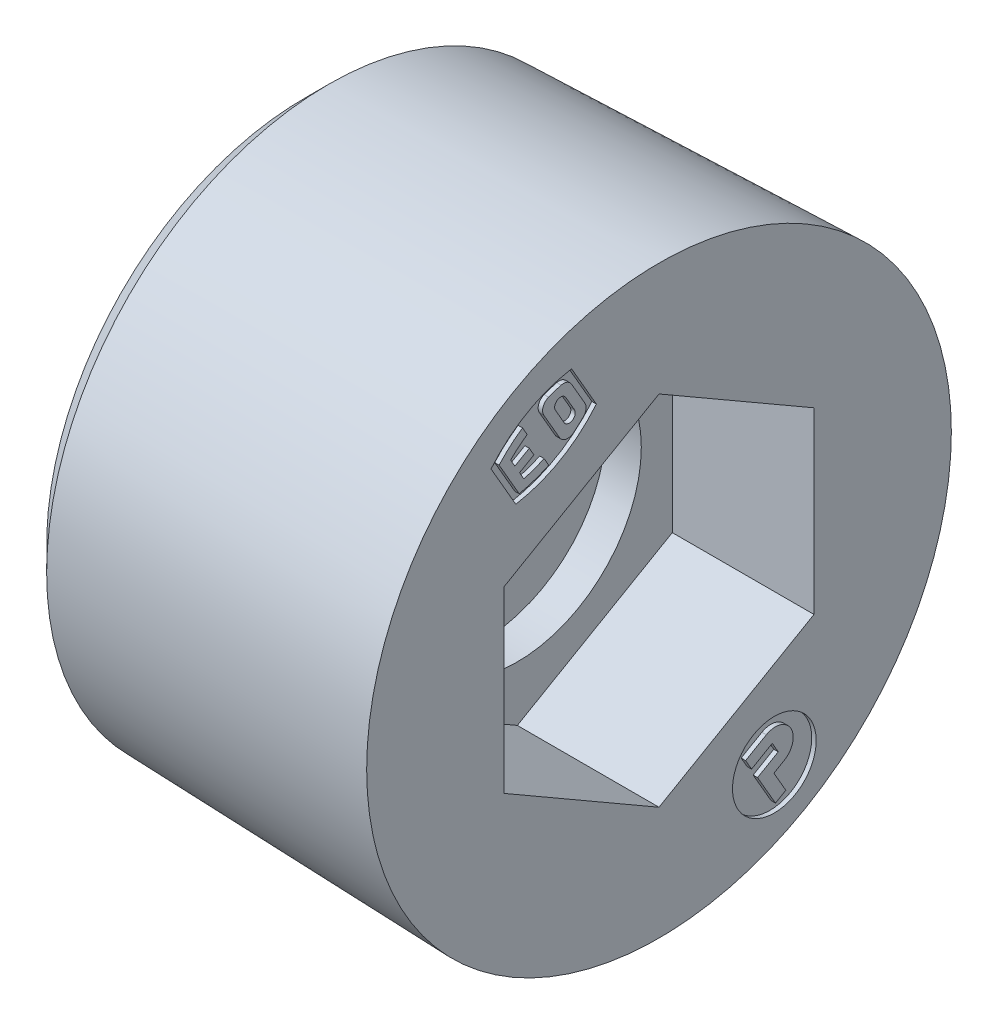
ISO-10303-21;
HEADER;
FILE_DESCRIPTION(('STEP AP214'),'2;1');
FILE_NAME('part.step','',(''),(''),'','','');
FILE_SCHEMA(('AUTOMOTIVE_DESIGN { 1 0 10303 214 1 1 1 1 }'));
ENDSEC;
DATA;
#1=APPLICATION_CONTEXT('core data for automotive mechanical design processes');
#2=APPLICATION_PROTOCOL_DEFINITION('international standard','automotive_design',2000,#1);
#3=PRODUCT_CONTEXT('',#1,'mechanical');
#4=PRODUCT('Part','Part','',(#3));
#5=PRODUCT_RELATED_PRODUCT_CATEGORY('part','',(#4));
#6=PRODUCT_DEFINITION_FORMATION('','',#4);
#7=PRODUCT_DEFINITION_CONTEXT('part definition',#1,'design');
#8=PRODUCT_DEFINITION('design','',#6,#7);
#9=PRODUCT_DEFINITION_SHAPE('','',#8);
#10=(LENGTH_UNIT() NAMED_UNIT(*) SI_UNIT(.MILLI.,.METRE.));
#11=(NAMED_UNIT(*) PLANE_ANGLE_UNIT() SI_UNIT($,.RADIAN.));
#12=(NAMED_UNIT(*) SI_UNIT($,.STERADIAN.) SOLID_ANGLE_UNIT());
#13=UNCERTAINTY_MEASURE_WITH_UNIT(LENGTH_MEASURE(1.E-05),#10,'distance_accuracy_value','');
#14=(GEOMETRIC_REPRESENTATION_CONTEXT(3) GLOBAL_UNCERTAINTY_ASSIGNED_CONTEXT((#13)) GLOBAL_UNIT_ASSIGNED_CONTEXT((#10,
#11,#12)) REPRESENTATION_CONTEXT('',''));
#15=CARTESIAN_POINT('',(0.,0.,0.));
#16=DIRECTION('',(0.,0.,1.));
#17=DIRECTION('',(1.,0.,0.));
#18=AXIS2_PLACEMENT_3D('',#15,#16,#17);
#19=CARTESIAN_POINT('',(0.,-8.37538719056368,-5.25122410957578));
#20=DIRECTION('',(1.,0.,0.));
#21=DIRECTION('',(0.,1.,0.));
#22=AXIS2_PLACEMENT_3D('',#19,#20,#21);
#23=PLANE('',#22);
#24=DIRECTION('',(0.,-0.499999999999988,0.866025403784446));
#25=VECTOR('',#24,1.);
#26=CARTESIAN_POINT('',(0.,-7.67390655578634,-4.84622420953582));
#27=LINE('',#26,#25);
#28=CARTESIAN_POINT('',(0.,-7.67390655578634,-4.84622420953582));
#29=VERTEX_POINT('',#28);
#30=CARTESIAN_POINT('',(0.,-8.21390655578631,-3.91091677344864));
#31=VERTEX_POINT('',#30);
#32=EDGE_CURVE('E430',#29,#31,#27,.T.);
#33=ORIENTED_EDGE('',*,*,#32,.T.);
#34=DIRECTION('',(0.,-0.866025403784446,-0.499999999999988));
#35=VECTOR('',#34,1.);
#36=CARTESIAN_POINT('',(0.,-8.21390655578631,-3.91091677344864));
#37=LINE('',#36,#35);
#38=CARTESIAN_POINT('',(0.,-8.68156027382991,-4.18091677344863));
#39=VERTEX_POINT('',#38);
#40=EDGE_CURVE('E412',#31,#39,#37,.T.);
#41=ORIENTED_EDGE('',*,*,#40,.T.);
#42=DIRECTION('',(0.,0.499999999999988,-0.866025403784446));
#43=VECTOR('',#42,1.);
#44=CARTESIAN_POINT('',(0.,-8.68156027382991,-4.18091677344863));
#45=LINE('',#44,#43);
#46=CARTESIAN_POINT('',(0.,-8.14156027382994,-5.11622420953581));
#47=VERTEX_POINT('',#46);
#48=EDGE_CURVE('E567',#39,#47,#45,.T.);
#49=ORIENTED_EDGE('',*,*,#48,.T.);
#50=DIRECTION('',(0.,-0.866025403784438,-0.5));
#51=VECTOR('',#50,1.);
#52=CARTESIAN_POINT('',(0.,-8.14156027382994,-5.11622420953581));
#53=LINE('',#52,#51);
#54=CARTESIAN_POINT('',(0.,-8.60921399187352,-5.38622420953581));
#55=VERTEX_POINT('',#54);
#56=EDGE_CURVE('E689',#47,#55,#53,.T.);
#57=ORIENTED_EDGE('',*,*,#56,.T.);
#58=DIRECTION('',(0.,-0.5,0.866025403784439));
#59=VECTOR('',#58,1.);
#60=CARTESIAN_POINT('',(0.,-8.60921399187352,-5.38622420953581));
#61=LINE('',#60,#59);
#62=CARTESIAN_POINT('',(0.,-9.14921399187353,-4.45091677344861));
#63=VERTEX_POINT('',#62);
#64=EDGE_CURVE('E688',#55,#63,#61,.T.);
#65=ORIENTED_EDGE('',*,*,#64,.T.);
#66=DIRECTION('',(0.,-0.866025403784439,-0.5));
#67=VECTOR('',#66,1.);
#68=CARTESIAN_POINT('',(0.,-9.14921399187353,-4.45091677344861));
#69=LINE('',#68,#67);
#70=CARTESIAN_POINT('',(0.,-10.5521751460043,-5.26091677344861));
#71=VERTEX_POINT('',#70);
#72=EDGE_CURVE('E666',#63,#71,#69,.T.);
#73=ORIENTED_EDGE('',*,*,#72,.T.);
#74=DIRECTION('',(0.,0.499999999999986,-0.866025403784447));
#75=VECTOR('',#74,1.);
#76=CARTESIAN_POINT('',(0.,-10.5521751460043,-5.26091677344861));
#77=LINE('',#76,#75);
#78=CARTESIAN_POINT('',(0.,-10.2821751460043,-5.72857049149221));
#79=VERTEX_POINT('',#78);
#80=EDGE_CURVE('E513',#71,#79,#77,.T.);
#81=ORIENTED_EDGE('',*,*,#80,.T.);
#82=DIRECTION('',(0.,0.866025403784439,0.5));
#83=VECTOR('',#82,1.);
#84=CARTESIAN_POINT('',(0.,-10.2821751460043,-5.72857049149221));
#85=LINE('',#84,#83);
#86=CARTESIAN_POINT('',(0.,-9.34686770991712,-5.1885704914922));
#87=VERTEX_POINT('',#86);
#88=EDGE_CURVE('E571',#79,#87,#85,.T.);
#89=ORIENTED_EDGE('',*,*,#88,.T.);
#90=DIRECTION('',(0.,0.5,-0.866025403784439));
#91=VECTOR('',#90,1.);
#92=CARTESIAN_POINT('',(0.,-9.34686770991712,-5.1885704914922));
#93=LINE('',#92,#91);
#94=CARTESIAN_POINT('',(0.,-9.07686770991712,-5.6562242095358));
#95=VERTEX_POINT('',#94);
#96=EDGE_CURVE('E497',#87,#95,#93,.T.);
#97=ORIENTED_EDGE('',*,*,#96,.T.);
#98=CARTESIAN_POINT('',(0.,-8.37538719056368,-5.25122410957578));
#99=DIRECTION('',(1.,0.,0.));
#100=DIRECTION('',(0.,0.,-1.));
#101=AXIS2_PLACEMENT_3D('',#98,#99,#100);
#102=CIRCLE('',#101,0.81);
#103=EDGE_CURVE('E11',#95,#29,#102,.T.);
#104=ORIENTED_EDGE('',*,*,#103,.T.);
#105=EDGE_LOOP('',(#33,#41,#49,#57,#65,#73,#81,#89,#97,#104));
#106=FACE_BOUND('',#105,.T.);
#107=ADVANCED_FACE('F16',(#106),#23,.T.);
#108=CARTESIAN_POINT('',(-0.2,-8.37538719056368,-5.25122410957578));
#109=DIRECTION('',(-1.,0.,0.));
#110=DIRECTION('',(0.,0.,-1.));
#111=AXIS2_PLACEMENT_3D('',#108,#109,#110);
#112=CYLINDRICAL_SURFACE('',#111,0.81);
#113=ORIENTED_EDGE('',*,*,#103,.F.);
#114=DIRECTION('',(1.,0.,0.));
#115=VECTOR('',#114,1.);
#116=CARTESIAN_POINT('',(-0.2,-9.07686770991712,-5.6562242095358));
#117=LINE('',#116,#115);
#118=CARTESIAN_POINT('',(-0.2,-9.07686770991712,-5.6562242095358));
#119=VERTEX_POINT('',#118);
#120=EDGE_CURVE('E27',#119,#95,#117,.T.);
#121=ORIENTED_EDGE('',*,*,#120,.F.);
#122=CARTESIAN_POINT('',(-0.2,-8.37538719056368,-5.25122410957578));
#123=DIRECTION('',(1.,0.,0.));
#124=DIRECTION('',(0.,0.,-1.));
#125=AXIS2_PLACEMENT_3D('',#122,#123,#124);
#126=CIRCLE('',#125,0.81);
#127=CARTESIAN_POINT('',(-0.2,-7.67390655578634,-4.84622420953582));
#128=VERTEX_POINT('',#127);
#129=EDGE_CURVE('E435',#119,#128,#126,.T.);
#130=ORIENTED_EDGE('',*,*,#129,.T.);
#131=DIRECTION('',(1.,0.,0.));
#132=VECTOR('',#131,1.);
#133=CARTESIAN_POINT('',(-0.2,-7.67390655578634,-4.84622420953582));
#134=LINE('',#133,#132);
#135=EDGE_CURVE('E418',#128,#29,#134,.T.);
#136=ORIENTED_EDGE('',*,*,#135,.T.);
#137=EDGE_LOOP('',(#113,#121,#130,#136));
#138=FACE_BOUND('',#137,.T.);
#139=ADVANCED_FACE('F1001',(#138),#112,.T.);
#140=CARTESIAN_POINT('',(-0.2,-9.34686770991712,-5.1885704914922));
#141=DIRECTION('',(0.,-0.866025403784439,-0.5));
#142=DIRECTION('',(0.,0.5,-0.866025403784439));
#143=AXIS2_PLACEMENT_3D('',#140,#141,#142);
#144=PLANE('',#143);
#145=ORIENTED_EDGE('',*,*,#96,.F.);
#146=DIRECTION('',(1.,0.,0.));
#147=VECTOR('',#146,1.);
#148=CARTESIAN_POINT('',(-0.2,-9.34686770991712,-5.1885704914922));
#149=LINE('',#148,#147);
#150=CARTESIAN_POINT('',(-0.2,-9.34686770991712,-5.1885704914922));
#151=VERTEX_POINT('',#150);
#152=EDGE_CURVE('E501',#151,#87,#149,.T.);
#153=ORIENTED_EDGE('',*,*,#152,.F.);
#154=DIRECTION('',(0.,0.5,-0.866025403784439));
#155=VECTOR('',#154,1.);
#156=CARTESIAN_POINT('',(-0.2,-9.34686770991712,-5.1885704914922));
#157=LINE('',#156,#155);
#158=EDGE_CURVE('E442',#151,#119,#157,.T.);
#159=ORIENTED_EDGE('',*,*,#158,.T.);
#160=ORIENTED_EDGE('',*,*,#120,.T.);
#161=EDGE_LOOP('',(#145,#153,#159,#160));
#162=FACE_BOUND('',#161,.T.);
#163=ADVANCED_FACE('F1007',(#162),#144,.T.);
#164=CARTESIAN_POINT('',(-0.2,-10.2821751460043,-5.72857049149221));
#165=DIRECTION('',(0.,0.5,-0.866025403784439));
#166=DIRECTION('',(-1.,0.,0.));
#167=AXIS2_PLACEMENT_3D('',#164,#165,#166);
#168=PLANE('',#167);
#169=ORIENTED_EDGE('',*,*,#88,.F.);
#170=DIRECTION('',(1.,0.,0.));
#171=VECTOR('',#170,1.);
#172=CARTESIAN_POINT('',(-0.2,-10.2821751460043,-5.72857049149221));
#173=LINE('',#172,#171);
#174=CARTESIAN_POINT('',(-0.2,-10.2821751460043,-5.72857049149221));
#175=VERTEX_POINT('',#174);
#176=EDGE_CURVE('E517',#175,#79,#173,.T.);
#177=ORIENTED_EDGE('',*,*,#176,.F.);
#178=DIRECTION('',(0.,0.866025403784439,0.5));
#179=VECTOR('',#178,1.);
#180=CARTESIAN_POINT('',(-0.2,-10.2821751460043,-5.72857049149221));
#181=LINE('',#180,#179);
#182=EDGE_CURVE('E487',#175,#151,#181,.T.);
#183=ORIENTED_EDGE('',*,*,#182,.T.);
#184=ORIENTED_EDGE('',*,*,#152,.T.);
#185=EDGE_LOOP('',(#169,#177,#183,#184));
#186=FACE_BOUND('',#185,.T.);
#187=ADVANCED_FACE('F1035',(#186),#168,.T.);
#188=CARTESIAN_POINT('',(-0.2,-10.5521751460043,-5.26091677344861));
#189=DIRECTION('',(0.,-0.866025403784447,-0.499999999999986));
#190=DIRECTION('',(0.,0.499999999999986,-0.866025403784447));
#191=AXIS2_PLACEMENT_3D('',#188,#189,#190);
#192=PLANE('',#191);
#193=ORIENTED_EDGE('',*,*,#80,.F.);
#194=DIRECTION('',(1.,0.,0.));
#195=VECTOR('',#194,1.);
#196=CARTESIAN_POINT('',(-0.2,-10.5521751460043,-5.26091677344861));
#197=LINE('',#196,#195);
#198=CARTESIAN_POINT('',(-0.2,-10.5521751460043,-5.26091677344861));
#199=VERTEX_POINT('',#198);
#200=EDGE_CURVE('E518',#199,#71,#197,.T.);
#201=ORIENTED_EDGE('',*,*,#200,.F.);
#202=DIRECTION('',(0.,0.499999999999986,-0.866025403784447));
#203=VECTOR('',#202,1.);
#204=CARTESIAN_POINT('',(-0.2,-10.5521751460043,-5.26091677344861));
#205=LINE('',#204,#203);
#206=EDGE_CURVE('E482',#199,#175,#205,.T.);
#207=ORIENTED_EDGE('',*,*,#206,.T.);
#208=ORIENTED_EDGE('',*,*,#176,.T.);
#209=EDGE_LOOP('',(#193,#201,#207,#208));
#210=FACE_BOUND('',#209,.T.);
#211=ADVANCED_FACE('F1106',(#210),#192,.T.);
#212=CARTESIAN_POINT('',(-0.2,-9.14921399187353,-4.45091677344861));
#213=DIRECTION('',(0.,-0.5,0.866025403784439));
#214=DIRECTION('',(-1.,0.,0.));
#215=AXIS2_PLACEMENT_3D('',#212,#213,#214);
#216=PLANE('',#215);
#217=ORIENTED_EDGE('',*,*,#72,.F.);
#218=DIRECTION('',(1.,0.,0.));
#219=VECTOR('',#218,1.);
#220=CARTESIAN_POINT('',(-0.2,-9.14921399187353,-4.45091677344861));
#221=LINE('',#220,#219);
#222=CARTESIAN_POINT('',(-0.2,-9.14921399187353,-4.45091677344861));
#223=VERTEX_POINT('',#222);
#224=EDGE_CURVE('E670',#223,#63,#221,.T.);
#225=ORIENTED_EDGE('',*,*,#224,.F.);
#226=DIRECTION('',(0.,-0.866025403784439,-0.5));
#227=VECTOR('',#226,1.);
#228=CARTESIAN_POINT('',(-0.2,-9.14921399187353,-4.45091677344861));
#229=LINE('',#228,#227);
#230=EDGE_CURVE('E486',#223,#199,#229,.T.);
#231=ORIENTED_EDGE('',*,*,#230,.T.);
#232=ORIENTED_EDGE('',*,*,#200,.T.);
#233=EDGE_LOOP('',(#217,#225,#231,#232));
#234=FACE_BOUND('',#233,.T.);
#235=ADVANCED_FACE('F1098',(#234),#216,.T.);
#236=CARTESIAN_POINT('',(-0.2,-8.60921399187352,-5.38622420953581));
#237=DIRECTION('',(0.,0.866025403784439,0.5));
#238=DIRECTION('',(1.,0.,0.));
#239=AXIS2_PLACEMENT_3D('',#236,#237,#238);
#240=PLANE('',#239);
#241=ORIENTED_EDGE('',*,*,#64,.F.);
#242=DIRECTION('',(1.,0.,0.));
#243=VECTOR('',#242,1.);
#244=CARTESIAN_POINT('',(-0.2,-8.60921399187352,-5.38622420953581));
#245=LINE('',#244,#243);
#246=CARTESIAN_POINT('',(-0.2,-8.60921399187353,-5.38622420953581));
#247=VERTEX_POINT('',#246);
#248=EDGE_CURVE('E685',#247,#55,#245,.T.);
#249=ORIENTED_EDGE('',*,*,#248,.F.);
#250=DIRECTION('',(0.,-0.5,0.866025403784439));
#251=VECTOR('',#250,1.);
#252=CARTESIAN_POINT('',(-0.2,-8.60921399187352,-5.38622420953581));
#253=LINE('',#252,#251);
#254=EDGE_CURVE('E460',#247,#223,#253,.T.);
#255=ORIENTED_EDGE('',*,*,#254,.T.);
#256=ORIENTED_EDGE('',*,*,#224,.T.);
#257=EDGE_LOOP('',(#241,#249,#255,#256));
#258=FACE_BOUND('',#257,.T.);
#259=ADVANCED_FACE('F1026',(#258),#240,.T.);
#260=CARTESIAN_POINT('',(-0.2,-8.14156027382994,-5.11622420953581));
#261=DIRECTION('',(0.,-0.5,0.866025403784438));
#262=DIRECTION('',(-1.,0.,0.));
#263=AXIS2_PLACEMENT_3D('',#260,#261,#262);
#264=PLANE('',#263);
#265=ORIENTED_EDGE('',*,*,#56,.F.);
#266=DIRECTION('',(1.,0.,0.));
#267=VECTOR('',#266,1.);
#268=CARTESIAN_POINT('',(-0.2,-8.14156027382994,-5.11622420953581));
#269=LINE('',#268,#267);
#270=CARTESIAN_POINT('',(-0.2,-8.14156027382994,-5.11622420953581));
#271=VERTEX_POINT('',#270);
#272=EDGE_CURVE('E798',#271,#47,#269,.T.);
#273=ORIENTED_EDGE('',*,*,#272,.F.);
#274=DIRECTION('',(0.,-0.866025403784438,-0.5));
#275=VECTOR('',#274,1.);
#276=CARTESIAN_POINT('',(-0.2,-8.14156027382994,-5.11622420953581));
#277=LINE('',#276,#275);
#278=EDGE_CURVE('E456',#271,#247,#277,.T.);
#279=ORIENTED_EDGE('',*,*,#278,.T.);
#280=ORIENTED_EDGE('',*,*,#248,.T.);
#281=EDGE_LOOP('',(#265,#273,#279,#280));
#282=FACE_BOUND('',#281,.T.);
#283=ADVANCED_FACE('F1020',(#282),#264,.T.);
#284=CARTESIAN_POINT('',(-0.2,-8.68156027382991,-4.18091677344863));
#285=DIRECTION('',(0.,-0.866025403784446,-0.499999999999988));
#286=DIRECTION('',(0.,0.499999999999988,-0.866025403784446));
#287=AXIS2_PLACEMENT_3D('',#284,#285,#286);
#288=PLANE('',#287);
#289=ORIENTED_EDGE('',*,*,#48,.F.);
#290=DIRECTION('',(1.,0.,0.));
#291=VECTOR('',#290,1.);
#292=CARTESIAN_POINT('',(-0.2,-8.68156027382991,-4.18091677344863));
#293=LINE('',#292,#291);
#294=CARTESIAN_POINT('',(-0.2,-8.68156027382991,-4.18091677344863));
#295=VERTEX_POINT('',#294);
#296=EDGE_CURVE('E564',#295,#39,#293,.T.);
#297=ORIENTED_EDGE('',*,*,#296,.F.);
#298=DIRECTION('',(0.,0.499999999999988,-0.866025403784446));
#299=VECTOR('',#298,1.);
#300=CARTESIAN_POINT('',(-0.2,-8.68156027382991,-4.18091677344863));
#301=LINE('',#300,#299);
#302=EDGE_CURVE('E428',#295,#271,#301,.T.);
#303=ORIENTED_EDGE('',*,*,#302,.T.);
#304=ORIENTED_EDGE('',*,*,#272,.T.);
#305=EDGE_LOOP('',(#289,#297,#303,#304));
#306=FACE_BOUND('',#305,.T.);
#307=ADVANCED_FACE('F1014',(#306),#288,.T.);
#308=CARTESIAN_POINT('',(-0.2,-8.21390655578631,-3.91091677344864));
#309=DIRECTION('',(0.,-0.499999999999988,0.866025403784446));
#310=DIRECTION('',(-1.,0.,0.));
#311=AXIS2_PLACEMENT_3D('',#308,#309,#310);
#312=PLANE('',#311);
#313=ORIENTED_EDGE('',*,*,#40,.F.);
#314=DIRECTION('',(1.,0.,0.));
#315=VECTOR('',#314,1.);
#316=CARTESIAN_POINT('',(-0.2,-8.21390655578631,-3.91091677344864));
#317=LINE('',#316,#315);
#318=CARTESIAN_POINT('',(-0.2,-8.21390655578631,-3.91091677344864));
#319=VERTEX_POINT('',#318);
#320=EDGE_CURVE('E405',#319,#31,#317,.T.);
#321=ORIENTED_EDGE('',*,*,#320,.F.);
#322=DIRECTION('',(0.,-0.866025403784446,-0.499999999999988));
#323=VECTOR('',#322,1.);
#324=CARTESIAN_POINT('',(-0.2,-8.21390655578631,-3.91091677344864));
#325=LINE('',#324,#323);
#326=EDGE_CURVE('E409',#319,#295,#325,.T.);
#327=ORIENTED_EDGE('',*,*,#326,.T.);
#328=ORIENTED_EDGE('',*,*,#296,.T.);
#329=EDGE_LOOP('',(#313,#321,#327,#328));
#330=FACE_BOUND('',#329,.T.);
#331=ADVANCED_FACE('F407',(#330),#312,.T.);
#332=CARTESIAN_POINT('',(-0.2,-7.67390655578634,-4.84622420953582));
#333=DIRECTION('',(0.,0.866025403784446,0.499999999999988));
#334=DIRECTION('',(1.,0.,0.));
#335=AXIS2_PLACEMENT_3D('',#332,#333,#334);
#336=PLANE('',#335);
#337=ORIENTED_EDGE('',*,*,#32,.F.);
#338=ORIENTED_EDGE('',*,*,#135,.F.);
#339=DIRECTION('',(0.,-0.499999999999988,0.866025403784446));
#340=VECTOR('',#339,1.);
#341=CARTESIAN_POINT('',(-0.2,-7.67390655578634,-4.84622420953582));
#342=LINE('',#341,#340);
#343=EDGE_CURVE('E425',#128,#319,#342,.T.);
#344=ORIENTED_EDGE('',*,*,#343,.T.);
#345=ORIENTED_EDGE('',*,*,#320,.T.);
#346=EDGE_LOOP('',(#337,#338,#344,#345));
#347=FACE_BOUND('',#346,.T.);
#348=ADVANCED_FACE('F432',(#347),#336,.T.);
#349=CARTESIAN_POINT('',(-0.2,-9.02304085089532,-5.2094550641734));
#350=DIRECTION('',(1.,0.,0.));
#351=DIRECTION('',(0.,1.,0.));
#352=AXIS2_PLACEMENT_3D('',#349,#350,#351);
#353=PLANE('',#352);
#354=ORIENTED_EDGE('',*,*,#343,.F.);
#355=ORIENTED_EDGE('',*,*,#129,.F.);
#356=ORIENTED_EDGE('',*,*,#158,.F.);
#357=ORIENTED_EDGE('',*,*,#182,.F.);
#358=ORIENTED_EDGE('',*,*,#206,.F.);
#359=ORIENTED_EDGE('',*,*,#230,.F.);
#360=ORIENTED_EDGE('',*,*,#254,.F.);
#361=ORIENTED_EDGE('',*,*,#278,.F.);
#362=ORIENTED_EDGE('',*,*,#302,.F.);
#363=ORIENTED_EDGE('',*,*,#326,.F.);
#364=EDGE_LOOP('',(#354,#355,#356,#357,#358,#359,#360,#361,#362,#363));
#365=FACE_BOUND('',#364,.T.);
#366=CARTESIAN_POINT('',(-0.2,-9.02304085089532,-5.2094550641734));
#367=DIRECTION('',(1.,0.,0.));
#368=DIRECTION('',(0.,0.,-1.));
#369=AXIS2_PLACEMENT_3D('',#366,#367,#368);
#370=CIRCLE('',#369,1.89);
#371=CARTESIAN_POINT('',(-0.2,-9.02304085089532,-7.0994550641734));
#372=VERTEX_POINT('',#371);
#373=EDGE_CURVE('E436',#372,#372,#370,.T.);
#374=ORIENTED_EDGE('',*,*,#373,.T.);
#375=EDGE_LOOP('',(#374));
#376=FACE_BOUND('',#375,.T.);
#377=ADVANCED_FACE('F422',(#365,#376),#353,.T.);
#378=CARTESIAN_POINT('',(-0.2,-9.02304085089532,-5.2094550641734));
#379=DIRECTION('',(-1.,0.,0.));
#380=DIRECTION('',(0.,0.,-1.));
#381=AXIS2_PLACEMENT_3D('',#378,#379,#380);
#382=CYLINDRICAL_SURFACE('',#381,1.89);
#383=ORIENTED_EDGE('',*,*,#373,.F.);
#384=EDGE_LOOP('',(#383));
#385=FACE_BOUND('',#384,.T.);
#386=CARTESIAN_POINT('',(0.,-9.02304085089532,-5.2094550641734));
#387=DIRECTION('',(1.,0.,0.));
#388=DIRECTION('',(0.,0.,-1.));
#389=AXIS2_PLACEMENT_3D('',#386,#387,#388);
#390=CIRCLE('',#389,1.89);
#391=CARTESIAN_POINT('',(0.,-9.02304085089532,-7.0994550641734));
#392=VERTEX_POINT('',#391);
#393=EDGE_CURVE('E512',#392,#392,#390,.T.);
#394=ORIENTED_EDGE('',*,*,#393,.T.);
#395=EDGE_LOOP('',(#394));
#396=FACE_BOUND('',#395,.T.);
#397=ADVANCED_FACE('F1201',(#385,#396),#382,.F.);
#398=CARTESIAN_POINT('',(-0.2,5.12592653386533,2.95945506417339));
#399=DIRECTION('',(1.,0.,0.));
#400=DIRECTION('',(0.,1.,0.));
#401=AXIS2_PLACEMENT_3D('',#398,#399,#400);
#402=PLANE('',#401);
#403=CARTESIAN_POINT('',(-0.2,9.240290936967,4.05316686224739));
#404=DIRECTION('',(1.,0.,0.));
#405=DIRECTION('',(0.,0.,-1.));
#406=AXIS2_PLACEMENT_3D('',#403,#404,#405);
#407=CIRCLE('',#406,0.27);
#408=CARTESIAN_POINT('',(-0.2,9.10529094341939,4.28699372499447));
#409=VERTEX_POINT('',#408);
#410=CARTESIAN_POINT('',(-0.2,9.37529094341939,3.81934000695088));
#411=VERTEX_POINT('',#410);
#412=EDGE_CURVE('E475',#409,#411,#407,.T.);
#413=ORIENTED_EDGE('',*,*,#412,.T.);
#414=DIRECTION('',(0.,0.866025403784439,0.5));
#415=VECTOR('',#414,1.);
#416=CARTESIAN_POINT('',(-0.2,9.37529094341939,3.81934000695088));
#417=LINE('',#416,#415);
#418=CARTESIAN_POINT('',(-0.2,10.0507907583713,4.20934000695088));
#419=VERTEX_POINT('',#418);
#420=EDGE_CURVE('E587',#411,#419,#417,.T.);
#421=ORIENTED_EDGE('',*,*,#420,.T.);
#422=CARTESIAN_POINT('',(-0.2,9.91579075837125,4.44316686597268));
#423=DIRECTION('',(1.,0.,0.));
#424=DIRECTION('',(0.,0.,-1.));
#425=AXIS2_PLACEMENT_3D('',#422,#423,#424);
#426=CIRCLE('',#425,0.27);
#427=CARTESIAN_POINT('',(-0.2,9.78079075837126,4.67699372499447));
#428=VERTEX_POINT('',#427);
#429=EDGE_CURVE('E578',#419,#428,#426,.T.);
#430=ORIENTED_EDGE('',*,*,#429,.T.);
#431=DIRECTION('',(0.,-0.866025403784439,-0.5));
#432=VECTOR('',#431,1.);
#433=CARTESIAN_POINT('',(-0.2,9.78079075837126,4.67699372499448));
#434=LINE('',#433,#432);
#435=EDGE_CURVE('E642',#428,#409,#434,.T.);
#436=ORIENTED_EDGE('',*,*,#435,.T.);
#437=EDGE_LOOP('',(#413,#421,#430,#436));
#438=FACE_BOUND('',#437,.T.);
#439=ADVANCED_FACE('F1010',(#438),#402,.T.);
#440=CARTESIAN_POINT('',(0.,5.12592653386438,2.95945506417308));
#441=DIRECTION('',(1.,0.,0.));
#442=DIRECTION('',(0.,1.,0.));
#443=AXIS2_PLACEMENT_3D('',#440,#441,#442);
#444=PLANE('',#443);
#445=DIRECTION('',(0.,0.866025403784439,0.5));
#446=VECTOR('',#445,1.);
#447=CARTESIAN_POINT('',(0.,9.37529094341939,3.81934000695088));
#448=LINE('',#447,#446);
#449=CARTESIAN_POINT('',(0.,9.37529094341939,3.81934000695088));
#450=VERTEX_POINT('',#449);
#451=CARTESIAN_POINT('',(0.,10.0507907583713,4.20934000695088));
#452=VERTEX_POINT('',#451);
#453=EDGE_CURVE('E588',#450,#452,#448,.T.);
#454=ORIENTED_EDGE('',*,*,#453,.F.);
#455=CARTESIAN_POINT('',(0.,9.240290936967,4.05316686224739));
#456=DIRECTION('',(1.,0.,0.));
#457=DIRECTION('',(0.,0.,-1.));
#458=AXIS2_PLACEMENT_3D('',#455,#456,#457);
#459=CIRCLE('',#458,0.27);
#460=CARTESIAN_POINT('',(0.,9.10529094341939,4.28699372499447));
#461=VERTEX_POINT('',#460);
#462=EDGE_CURVE('E490',#461,#450,#459,.T.);
#463=ORIENTED_EDGE('',*,*,#462,.F.);
#464=DIRECTION('',(0.,-0.866025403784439,-0.5));
#465=VECTOR('',#464,1.);
#466=CARTESIAN_POINT('',(0.,9.78079075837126,4.67699372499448));
#467=LINE('',#466,#465);
#468=CARTESIAN_POINT('',(0.,9.78079075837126,4.67699372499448));
#469=VERTEX_POINT('',#468);
#470=EDGE_CURVE('E474',#469,#461,#467,.T.);
#471=ORIENTED_EDGE('',*,*,#470,.F.);
#472=CARTESIAN_POINT('',(0.,9.91579075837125,4.44316686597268));
#473=DIRECTION('',(1.,0.,0.));
#474=DIRECTION('',(0.,0.,-1.));
#475=AXIS2_PLACEMENT_3D('',#472,#473,#474);
#476=CIRCLE('',#475,0.27);
#477=EDGE_CURVE('E582',#452,#469,#476,.T.);
#478=ORIENTED_EDGE('',*,*,#477,.F.);
#479=EDGE_LOOP('',(#454,#463,#471,#478));
#480=FACE_BOUND('',#479,.T.);
#481=CARTESIAN_POINT('',(0.,5.12592653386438,2.95945506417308));
#482=DIRECTION('',(1.,0.,0.));
#483=DIRECTION('',(0.,0.,-1.));
#484=AXIS2_PLACEMENT_3D('',#481,#482,#483);
#485=CIRCLE('',#484,5.7);
#486=CARTESIAN_POINT('',(0.,10.6355723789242,4.42020920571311));
#487=VERTEX_POINT('',#486);
#488=CARTESIAN_POINT('',(0.,10.4528108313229,4.98782970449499));
#489=VERTEX_POINT('',#488);
#490=EDGE_CURVE('E649',#487,#489,#485,.T.);
#491=ORIENTED_EDGE('',*,*,#490,.T.);
#492=CARTESIAN_POINT('',(0.,10.0603035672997,4.83837052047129));
#493=DIRECTION('',(1.,0.,0.));
#494=DIRECTION('',(0.,0.,-1.));
#495=AXIS2_PLACEMENT_3D('',#492,#493,#494);
#496=CIRCLE('',#495,0.42);
#497=CARTESIAN_POINT('',(0.,9.85030356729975,5.20210119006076));
#498=VERTEX_POINT('',#497);
#499=EDGE_CURVE('E455',#489,#498,#496,.T.);
#500=ORIENTED_EDGE('',*,*,#499,.T.);
#501=DIRECTION('',(0.,-0.866025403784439,-0.5));
#502=VECTOR('',#501,1.);
#503=CARTESIAN_POINT('',(0.,9.85030356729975,5.20210119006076));
#504=LINE('',#503,#502);
#505=CARTESIAN_POINT('',(0.,8.61577813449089,4.48934759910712));
#506=VERTEX_POINT('',#505);
#507=EDGE_CURVE('E454',#498,#506,#504,.T.);
#508=ORIENTED_EDGE('',*,*,#507,.T.);
#509=CARTESIAN_POINT('',(0.,8.82577813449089,4.12561692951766));
#510=DIRECTION('',(1.,0.,0.));
#511=DIRECTION('',(0.,0.,-1.));
#512=AXIS2_PLACEMENT_3D('',#509,#510,#511);
#513=CIRCLE('',#512,0.42);
#514=CARTESIAN_POINT('',(0.,8.50008902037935,3.86042529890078));
#515=VERTEX_POINT('',#514);
#516=EDGE_CURVE('E598',#506,#515,#513,.T.);
#517=ORIENTED_EDGE('',*,*,#516,.T.);
#518=CARTESIAN_POINT('',(0.,12.9201551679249,7.45945506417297));
#519=DIRECTION('',(1.,0.,0.));
#520=DIRECTION('',(0.,0.,-1.));
#521=AXIS2_PLACEMENT_3D('',#518,#519,#520);
#522=CIRCLE('',#521,5.7);
#523=CARTESIAN_POINT('',(0.,8.90028205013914,3.41833886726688));
#524=VERTEX_POINT('',#523);
#525=EDGE_CURVE('E597',#515,#524,#522,.T.);
#526=ORIENTED_EDGE('',*,*,#525,.T.);
#527=CARTESIAN_POINT('',(0.,9.19648322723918,3.71610532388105));
#528=DIRECTION('',(1.,0.,0.));
#529=DIRECTION('',(0.,0.,-1.));
#530=AXIS2_PLACEMENT_3D('',#527,#528,#529);
#531=CIRCLE('',#530,0.42);
#532=CARTESIAN_POINT('',(0.,9.40648322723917,3.35237465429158));
#533=VERTEX_POINT('',#532);
#534=EDGE_CURVE('E476',#524,#533,#531,.T.);
#535=ORIENTED_EDGE('',*,*,#534,.T.);
#536=DIRECTION('',(0.,0.866025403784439,0.5));
#537=VECTOR('',#536,1.);
#538=CARTESIAN_POINT('',(0.,9.40648322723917,3.35237465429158));
#539=LINE('',#538,#537);
#540=CARTESIAN_POINT('',(0.,10.4395984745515,3.94884402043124));
#541=VERTEX_POINT('',#540);
#542=EDGE_CURVE('E559',#533,#541,#539,.T.);
#543=ORIENTED_EDGE('',*,*,#542,.T.);
#544=CARTESIAN_POINT('',(0.,10.2295984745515,4.31257469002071));
#545=DIRECTION('',(1.,0.,0.));
#546=DIRECTION('',(0.,0.,-1.));
#547=AXIS2_PLACEMENT_3D('',#544,#545,#546);
#548=CIRCLE('',#547,0.42);
#549=EDGE_CURVE('E445',#541,#487,#548,.T.);
#550=ORIENTED_EDGE('',*,*,#549,.T.);
#551=EDGE_LOOP('',(#491,#500,#508,#517,#526,#535,#543,#550));
#552=FACE_BOUND('',#551,.T.);
#553=ADVANCED_FACE('F923',(#480,#552),#444,.T.);
#554=CARTESIAN_POINT('',(-0.2,10.2295984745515,4.31257469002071));
#555=DIRECTION('',(-1.,0.,0.));
#556=DIRECTION('',(0.,0.,-1.));
#557=AXIS2_PLACEMENT_3D('',#554,#555,#556);
#558=CYLINDRICAL_SURFACE('',#557,0.42);
#559=ORIENTED_EDGE('',*,*,#549,.F.);
#560=DIRECTION('',(1.,0.,0.));
#561=VECTOR('',#560,1.);
#562=CARTESIAN_POINT('',(-0.2,10.4395984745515,3.94884402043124));
#563=LINE('',#562,#561);
#564=CARTESIAN_POINT('',(-0.2,10.4395984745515,3.94884402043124));
#565=VERTEX_POINT('',#564);
#566=EDGE_CURVE('E563',#565,#541,#563,.T.);
#567=ORIENTED_EDGE('',*,*,#566,.F.);
#568=CARTESIAN_POINT('',(-0.2,10.2295984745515,4.31257469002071));
#569=DIRECTION('',(1.,0.,0.));
#570=DIRECTION('',(0.,0.,-1.));
#571=AXIS2_PLACEMENT_3D('',#568,#569,#570);
#572=CIRCLE('',#571,0.42);
#573=CARTESIAN_POINT('',(-0.2,10.6355723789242,4.42020920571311));
#574=VERTEX_POINT('',#573);
#575=EDGE_CURVE('E604',#565,#574,#572,.T.);
#576=ORIENTED_EDGE('',*,*,#575,.T.);
#577=DIRECTION('',(1.,0.,0.));
#578=VECTOR('',#577,1.);
#579=CARTESIAN_POINT('',(-0.2,10.6355723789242,4.42020920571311));
#580=LINE('',#579,#578);
#581=EDGE_CURVE('E653',#574,#487,#580,.T.);
#582=ORIENTED_EDGE('',*,*,#581,.T.);
#583=EDGE_LOOP('',(#559,#567,#576,#582));
#584=FACE_BOUND('',#583,.T.);
#585=ADVANCED_FACE('F1044',(#584),#558,.T.);
#586=CARTESIAN_POINT('',(-0.2,9.91579075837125,4.44316686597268));
#587=DIRECTION('',(-1.,0.,0.));
#588=DIRECTION('',(0.,0.,-1.));
#589=AXIS2_PLACEMENT_3D('',#586,#587,#588);
#590=CYLINDRICAL_SURFACE('',#589,0.27);
#591=ORIENTED_EDGE('',*,*,#477,.T.);
#592=DIRECTION('',(1.,0.,0.));
#593=VECTOR('',#592,1.);
#594=CARTESIAN_POINT('',(-0.2,9.78079075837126,4.67699372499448));
#595=LINE('',#594,#593);
#596=EDGE_CURVE('E449',#428,#469,#595,.T.);
#597=ORIENTED_EDGE('',*,*,#596,.F.);
#598=ORIENTED_EDGE('',*,*,#429,.F.);
#599=DIRECTION('',(1.,0.,0.));
#600=VECTOR('',#599,1.);
#601=CARTESIAN_POINT('',(-0.2,10.0507907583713,4.20934000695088));
#602=LINE('',#601,#600);
#603=EDGE_CURVE('E583',#419,#452,#602,.T.);
#604=ORIENTED_EDGE('',*,*,#603,.T.);
#605=EDGE_LOOP('',(#591,#597,#598,#604));
#606=FACE_BOUND('',#605,.T.);
#607=ADVANCED_FACE('F1050',(#606),#590,.F.);
#608=CARTESIAN_POINT('',(-0.2,9.78079075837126,4.67699372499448));
#609=DIRECTION('',(0.,-0.5,0.866025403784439));
#610=DIRECTION('',(-1.,0.,0.));
#611=AXIS2_PLACEMENT_3D('',#608,#609,#610);
#612=PLANE('',#611);
#613=ORIENTED_EDGE('',*,*,#470,.T.);
#614=DIRECTION('',(1.,0.,0.));
#615=VECTOR('',#614,1.);
#616=CARTESIAN_POINT('',(-0.2,9.10529094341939,4.28699372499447));
#617=LINE('',#616,#615);
#618=EDGE_CURVE('E470',#409,#461,#617,.T.);
#619=ORIENTED_EDGE('',*,*,#618,.F.);
#620=ORIENTED_EDGE('',*,*,#435,.F.);
#621=ORIENTED_EDGE('',*,*,#596,.T.);
#622=EDGE_LOOP('',(#613,#619,#620,#621));
#623=FACE_BOUND('',#622,.T.);
#624=ADVANCED_FACE('F1047',(#623),#612,.F.);
#625=CARTESIAN_POINT('',(-0.2,9.240290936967,4.05316686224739));
#626=DIRECTION('',(-1.,0.,0.));
#627=DIRECTION('',(0.,0.,-1.));
#628=AXIS2_PLACEMENT_3D('',#625,#626,#627);
#629=CYLINDRICAL_SURFACE('',#628,0.27);
#630=ORIENTED_EDGE('',*,*,#462,.T.);
#631=DIRECTION('',(1.,0.,0.));
#632=VECTOR('',#631,1.);
#633=CARTESIAN_POINT('',(-0.2,9.37529094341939,3.81934000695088));
#634=LINE('',#633,#632);
#635=EDGE_CURVE('E660',#411,#450,#634,.T.);
#636=ORIENTED_EDGE('',*,*,#635,.F.);
#637=ORIENTED_EDGE('',*,*,#412,.F.);
#638=ORIENTED_EDGE('',*,*,#618,.T.);
#639=EDGE_LOOP('',(#630,#636,#637,#638));
#640=FACE_BOUND('',#639,.T.);
#641=ADVANCED_FACE('F1049',(#640),#629,.F.);
#642=CARTESIAN_POINT('',(-0.2,9.37529094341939,3.81934000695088));
#643=DIRECTION('',(0.,0.5,-0.866025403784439));
#644=DIRECTION('',(-1.,0.,0.));
#645=AXIS2_PLACEMENT_3D('',#642,#643,#644);
#646=PLANE('',#645);
#647=ORIENTED_EDGE('',*,*,#453,.T.);
#648=ORIENTED_EDGE('',*,*,#603,.F.);
#649=ORIENTED_EDGE('',*,*,#420,.F.);
#650=ORIENTED_EDGE('',*,*,#635,.T.);
#651=EDGE_LOOP('',(#647,#648,#649,#650));
#652=FACE_BOUND('',#651,.T.);
#653=ADVANCED_FACE('F1149',(#652),#646,.F.);
#654=CARTESIAN_POINT('',(-0.2,9.40648322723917,3.35237465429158));
#655=DIRECTION('',(0.,0.5,-0.866025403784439));
#656=DIRECTION('',(-1.,0.,0.));
#657=AXIS2_PLACEMENT_3D('',#654,#655,#656);
#658=PLANE('',#657);
#659=ORIENTED_EDGE('',*,*,#542,.F.);
#660=DIRECTION('',(1.,0.,0.));
#661=VECTOR('',#660,1.);
#662=CARTESIAN_POINT('',(-0.2,9.40648322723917,3.35237465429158));
#663=LINE('',#662,#661);
#664=CARTESIAN_POINT('',(-0.2,9.40648322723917,3.35237465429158));
#665=VERTEX_POINT('',#664);
#666=EDGE_CURVE('E480',#665,#533,#663,.T.);
#667=ORIENTED_EDGE('',*,*,#666,.F.);
#668=DIRECTION('',(0.,0.866025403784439,0.5));
#669=VECTOR('',#668,1.);
#670=CARTESIAN_POINT('',(-0.2,9.40648322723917,3.35237465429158));
#671=LINE('',#670,#669);
#672=EDGE_CURVE('E599',#665,#565,#671,.T.);
#673=ORIENTED_EDGE('',*,*,#672,.T.);
#674=ORIENTED_EDGE('',*,*,#566,.T.);
#675=EDGE_LOOP('',(#659,#667,#673,#674));
#676=FACE_BOUND('',#675,.T.);
#677=ADVANCED_FACE('F1041',(#676),#658,.T.);
#678=CARTESIAN_POINT('',(-0.2,9.19648322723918,3.71610532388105));
#679=DIRECTION('',(-1.,0.,0.));
#680=DIRECTION('',(0.,0.,-1.));
#681=AXIS2_PLACEMENT_3D('',#678,#679,#680);
#682=CYLINDRICAL_SURFACE('',#681,0.42);
#683=ORIENTED_EDGE('',*,*,#534,.F.);
#684=DIRECTION('',(1.,0.,0.));
#685=VECTOR('',#684,1.);
#686=CARTESIAN_POINT('',(-0.2,8.90028205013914,3.41833886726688));
#687=LINE('',#686,#685);
#688=CARTESIAN_POINT('',(-0.2,8.90028205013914,3.41833886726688));
#689=VERTEX_POINT('',#688);
#690=EDGE_CURVE('E481',#689,#524,#687,.T.);
#691=ORIENTED_EDGE('',*,*,#690,.F.);
#692=CARTESIAN_POINT('',(-0.2,9.19648322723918,3.71610532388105));
#693=DIRECTION('',(1.,0.,0.));
#694=DIRECTION('',(0.,0.,-1.));
#695=AXIS2_PLACEMENT_3D('',#692,#693,#694);
#696=CIRCLE('',#695,0.42);
#697=EDGE_CURVE('E603',#689,#665,#696,.T.);
#698=ORIENTED_EDGE('',*,*,#697,.T.);
#699=ORIENTED_EDGE('',*,*,#666,.T.);
#700=EDGE_LOOP('',(#683,#691,#698,#699));
#701=FACE_BOUND('',#700,.T.);
#702=ADVANCED_FACE('F1037',(#701),#682,.T.);
#703=CARTESIAN_POINT('',(-0.2,12.9201551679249,7.45945506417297));
#704=DIRECTION('',(-1.,0.,0.));
#705=DIRECTION('',(0.,0.,-1.));
#706=AXIS2_PLACEMENT_3D('',#703,#704,#705);
#707=CYLINDRICAL_SURFACE('',#706,5.7);
#708=ORIENTED_EDGE('',*,*,#525,.F.);
#709=DIRECTION('',(1.,0.,0.));
#710=VECTOR('',#709,1.);
#711=CARTESIAN_POINT('',(-0.2,8.50008902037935,3.86042529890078));
#712=LINE('',#711,#710);
#713=CARTESIAN_POINT('',(-0.2,8.50008902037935,3.86042529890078));
#714=VERTEX_POINT('',#713);
#715=EDGE_CURVE('E593',#714,#515,#712,.T.);
#716=ORIENTED_EDGE('',*,*,#715,.F.);
#717=CARTESIAN_POINT('',(-0.2,12.9201551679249,7.45945506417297));
#718=DIRECTION('',(1.,0.,0.));
#719=DIRECTION('',(0.,0.,-1.));
#720=AXIS2_PLACEMENT_3D('',#717,#718,#719);
#721=CIRCLE('',#720,5.7);
#722=EDGE_CURVE('E617',#714,#689,#721,.T.);
#723=ORIENTED_EDGE('',*,*,#722,.T.);
#724=ORIENTED_EDGE('',*,*,#690,.T.);
#725=EDGE_LOOP('',(#708,#716,#723,#724));
#726=FACE_BOUND('',#725,.T.);
#727=ADVANCED_FACE('F1040',(#726),#707,.T.);
#728=CARTESIAN_POINT('',(-0.2,8.82577813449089,4.12561692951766));
#729=DIRECTION('',(-1.,0.,0.));
#730=DIRECTION('',(0.,0.,-1.));
#731=AXIS2_PLACEMENT_3D('',#728,#729,#730);
#732=CYLINDRICAL_SURFACE('',#731,0.42);
#733=ORIENTED_EDGE('',*,*,#516,.F.);
#734=DIRECTION('',(1.,0.,0.));
#735=VECTOR('',#734,1.);
#736=CARTESIAN_POINT('',(-0.2,8.61577813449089,4.48934759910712));
#737=LINE('',#736,#735);
#738=CARTESIAN_POINT('',(-0.2,8.61577813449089,4.48934759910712));
#739=VERTEX_POINT('',#738);
#740=EDGE_CURVE('E630',#739,#506,#737,.T.);
#741=ORIENTED_EDGE('',*,*,#740,.F.);
#742=CARTESIAN_POINT('',(-0.2,8.82577813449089,4.12561692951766));
#743=DIRECTION('',(1.,0.,0.));
#744=DIRECTION('',(0.,0.,-1.));
#745=AXIS2_PLACEMENT_3D('',#742,#743,#744);
#746=CIRCLE('',#745,0.42);
#747=EDGE_CURVE('E612',#739,#714,#746,.T.);
#748=ORIENTED_EDGE('',*,*,#747,.T.);
#749=ORIENTED_EDGE('',*,*,#715,.T.);
#750=EDGE_LOOP('',(#733,#741,#748,#749));
#751=FACE_BOUND('',#750,.T.);
#752=ADVANCED_FACE('F1031',(#751),#732,.T.);
#753=CARTESIAN_POINT('',(-0.2,9.85030356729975,5.20210119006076));
#754=DIRECTION('',(0.,-0.5,0.866025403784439));
#755=DIRECTION('',(-1.,0.,0.));
#756=AXIS2_PLACEMENT_3D('',#753,#754,#755);
#757=PLANE('',#756);
#758=ORIENTED_EDGE('',*,*,#507,.F.);
#759=DIRECTION('',(1.,0.,0.));
#760=VECTOR('',#759,1.);
#761=CARTESIAN_POINT('',(-0.2,9.85030356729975,5.20210119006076));
#762=LINE('',#761,#760);
#763=CARTESIAN_POINT('',(-0.2,9.85030356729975,5.20210119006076));
#764=VERTEX_POINT('',#763);
#765=EDGE_CURVE('E451',#764,#498,#762,.T.);
#766=ORIENTED_EDGE('',*,*,#765,.F.);
#767=DIRECTION('',(0.,-0.866025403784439,-0.5));
#768=VECTOR('',#767,1.);
#769=CARTESIAN_POINT('',(-0.2,9.85030356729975,5.20210119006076));
#770=LINE('',#769,#768);
#771=EDGE_CURVE('E616',#764,#739,#770,.T.);
#772=ORIENTED_EDGE('',*,*,#771,.T.);
#773=ORIENTED_EDGE('',*,*,#740,.T.);
#774=EDGE_LOOP('',(#758,#766,#772,#773));
#775=FACE_BOUND('',#774,.T.);
#776=ADVANCED_FACE('F917',(#775),#757,.T.);
#777=CARTESIAN_POINT('',(-0.2,10.0603035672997,4.83837052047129));
#778=DIRECTION('',(-1.,0.,0.));
#779=DIRECTION('',(0.,0.,-1.));
#780=AXIS2_PLACEMENT_3D('',#777,#778,#779);
#781=CYLINDRICAL_SURFACE('',#780,0.42);
#782=ORIENTED_EDGE('',*,*,#499,.F.);
#783=DIRECTION('',(1.,0.,0.));
#784=VECTOR('',#783,1.);
#785=CARTESIAN_POINT('',(-0.2,10.4528108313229,4.98782970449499));
#786=LINE('',#785,#784);
#787=CARTESIAN_POINT('',(-0.2,10.4528108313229,4.98782970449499));
#788=VERTEX_POINT('',#787);
#789=EDGE_CURVE('E877',#788,#489,#786,.T.);
#790=ORIENTED_EDGE('',*,*,#789,.F.);
#791=CARTESIAN_POINT('',(-0.2,10.0603035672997,4.83837052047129));
#792=DIRECTION('',(1.,0.,0.));
#793=DIRECTION('',(0.,0.,-1.));
#794=AXIS2_PLACEMENT_3D('',#791,#792,#793);
#795=CIRCLE('',#794,0.42);
#796=EDGE_CURVE('E626',#788,#764,#795,.T.);
#797=ORIENTED_EDGE('',*,*,#796,.T.);
#798=ORIENTED_EDGE('',*,*,#765,.T.);
#799=EDGE_LOOP('',(#782,#790,#797,#798));
#800=FACE_BOUND('',#799,.T.);
#801=ADVANCED_FACE('F928',(#800),#781,.T.);
#802=CARTESIAN_POINT('',(-0.2,5.12592653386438,2.95945506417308));
#803=DIRECTION('',(-1.,0.,0.));
#804=DIRECTION('',(0.,0.,-1.));
#805=AXIS2_PLACEMENT_3D('',#802,#803,#804);
#806=CYLINDRICAL_SURFACE('',#805,5.7);
#807=ORIENTED_EDGE('',*,*,#490,.F.);
#808=ORIENTED_EDGE('',*,*,#581,.F.);
#809=CARTESIAN_POINT('',(-0.2,5.12592653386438,2.95945506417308));
#810=DIRECTION('',(1.,0.,0.));
#811=DIRECTION('',(0.,0.,-1.));
#812=AXIS2_PLACEMENT_3D('',#809,#810,#811);
#813=CIRCLE('',#812,5.7);
#814=EDGE_CURVE('E880',#574,#788,#813,.T.);
#815=ORIENTED_EDGE('',*,*,#814,.T.);
#816=ORIENTED_EDGE('',*,*,#789,.T.);
#817=EDGE_LOOP('',(#807,#808,#815,#816));
#818=FACE_BOUND('',#817,.T.);
#819=ADVANCED_FACE('F931',(#818),#806,.T.);
#820=CARTESIAN_POINT('',(0.,5.1259265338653,2.95945506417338));
#821=DIRECTION('',(1.,0.,0.));
#822=DIRECTION('',(0.,1.,0.));
#823=AXIS2_PLACEMENT_3D('',#820,#821,#822);
#824=PLANE('',#823);
#825=CARTESIAN_POINT('',(0.,5.1259265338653,2.95945506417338));
#826=DIRECTION('',(1.,0.,0.));
#827=DIRECTION('',(0.,0.,-1.));
#828=AXIS2_PLACEMENT_3D('',#825,#826,#827);
#829=CIRCLE('',#828,5.7);
#830=CARTESIAN_POINT('',(0.,9.83885249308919,6.16543836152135));
#831=VERTEX_POINT('',#830);
#832=CARTESIAN_POINT('',(0.,8.90967503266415,7.22246424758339));
#833=VERTEX_POINT('',#832);
#834=EDGE_CURVE('E719',#831,#833,#829,.T.);
#835=ORIENTED_EDGE('',*,*,#834,.T.);
#836=DIRECTION('',(0.,-0.866025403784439,-0.5));
#837=VECTOR('',#836,1.);
#838=CARTESIAN_POINT('',(0.,8.90967503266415,7.22246424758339));
#839=LINE('',#838,#837);
#840=CARTESIAN_POINT('',(0.,7.3364066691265,6.3141373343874));
#841=VERTEX_POINT('',#840);
#842=EDGE_CURVE('E610',#833,#841,#839,.T.);
#843=ORIENTED_EDGE('',*,*,#842,.T.);
#844=CARTESIAN_POINT('',(0.,12.9201551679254,7.45945506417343));
#845=DIRECTION('',(1.,0.,0.));
#846=DIRECTION('',(0.,0.,-1.));
#847=AXIS2_PLACEMENT_3D('',#844,#845,#846);
#848=CIRCLE('',#847,5.7);
#849=CARTESIAN_POINT('',(0.,7.78722920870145,4.98093310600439));
#850=VERTEX_POINT('',#849);
#851=EDGE_CURVE('E761',#841,#850,#848,.T.);
#852=ORIENTED_EDGE('',*,*,#851,.T.);
#853=DIRECTION('',(0.,0.866025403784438,0.5));
#854=VECTOR('',#853,1.);
#855=CARTESIAN_POINT('',(0.,7.78722920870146,4.98093310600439));
#856=LINE('',#855,#854);
#857=CARTESIAN_POINT('',(0.,8.15203055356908,5.19155126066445));
#858=VERTEX_POINT('',#857);
#859=EDGE_CURVE('E742',#850,#858,#856,.T.);
#860=ORIENTED_EDGE('',*,*,#859,.T.);
#861=CARTESIAN_POINT('',(0.,12.9201551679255,7.45945506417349));
#862=DIRECTION('',(1.,0.,0.));
#863=DIRECTION('',(0.,0.,-1.));
#864=AXIS2_PLACEMENT_3D('',#861,#862,#863);
#865=CIRCLE('',#864,5.28);
#866=CARTESIAN_POINT('',(0.,7.81648322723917,6.10633543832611));
#867=VERTEX_POINT('',#866);
#868=EDGE_CURVE('E770',#867,#858,#865,.T.);
#869=ORIENTED_EDGE('',*,*,#868,.F.);
#870=DIRECTION('',(0.,0.86602540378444,0.5));
#871=VECTOR('',#870,1.);
#872=CARTESIAN_POINT('',(0.,7.81648322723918,6.1063354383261));
#873=LINE('',#872,#871);
#874=CARTESIAN_POINT('',(0.,8.15117551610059,6.29957012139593));
#875=VERTEX_POINT('',#874);
#876=EDGE_CURVE('E769',#867,#875,#873,.T.);
#877=ORIENTED_EDGE('',*,*,#876,.T.);
#878=DIRECTION('',(0.,0.5,-0.86602540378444));
#879=VECTOR('',#878,1.);
#880=CARTESIAN_POINT('',(0.,8.15117551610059,6.29957012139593));
#881=LINE('',#880,#879);
#882=CARTESIAN_POINT('',(0.,8.52617551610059,5.6500510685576));
#883=VERTEX_POINT('',#882);
#884=EDGE_CURVE('E699',#875,#883,#881,.T.);
#885=ORIENTED_EDGE('',*,*,#884,.T.);
#886=DIRECTION('',(0.,0.86602540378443,0.500000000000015));
#887=VECTOR('',#886,1.);
#888=CARTESIAN_POINT('',(0.,8.52617551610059,5.6500510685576));
#889=LINE('',#888,#887);
#890=CARTESIAN_POINT('',(0.,8.88990618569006,5.8600510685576));
#891=VERTEX_POINT('',#890);
#892=EDGE_CURVE('E698',#883,#891,#889,.T.);
#893=ORIENTED_EDGE('',*,*,#892,.T.);
#894=DIRECTION('',(0.,-0.5,0.86602540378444));
#895=VECTOR('',#894,1.);
#896=CARTESIAN_POINT('',(0.,8.88990618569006,5.8600510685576));
#897=LINE('',#896,#895);
#898=CARTESIAN_POINT('',(0.,8.51490618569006,6.50957012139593));
#899=VERTEX_POINT('',#898);
#900=EDGE_CURVE('E524',#891,#899,#897,.T.);
#901=ORIENTED_EDGE('',*,*,#900,.T.);
#902=DIRECTION('',(0.,0.866025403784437,0.5));
#903=VECTOR('',#902,1.);
#904=CARTESIAN_POINT('',(0.,8.51490618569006,6.50957012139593));
#905=LINE('',#904,#903);
#906=CARTESIAN_POINT('',(0.,8.84959847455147,6.70280480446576));
#907=VERTEX_POINT('',#906);
#908=EDGE_CURVE('E786',#899,#907,#905,.T.);
#909=ORIENTED_EDGE('',*,*,#908,.T.);
#910=CARTESIAN_POINT('',(0.,5.12592653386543,2.95945506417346));
#911=DIRECTION('',(1.,0.,0.));
#912=DIRECTION('',(0.,0.,-1.));
#913=AXIS2_PLACEMENT_3D('',#910,#911,#912);
#914=CIRCLE('',#913,5.28);
#915=CARTESIAN_POINT('',(0.,9.47405114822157,5.95482020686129));
#916=VERTEX_POINT('',#915);
#917=EDGE_CURVE('E592',#916,#907,#914,.T.);
#918=ORIENTED_EDGE('',*,*,#917,.F.);
#919=DIRECTION('',(0.,0.866025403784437,0.5));
#920=VECTOR('',#919,1.);
#921=CARTESIAN_POINT('',(0.,9.47405114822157,5.95482020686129));
#922=LINE('',#921,#920);
#923=EDGE_CURVE('E591',#916,#831,#922,.T.);
#924=ORIENTED_EDGE('',*,*,#923,.T.);
#925=EDGE_LOOP('',(#835,#843,#852,#860,#869,#877,#885,#893,#901,#909,#918,#924));
#926=FACE_BOUND('',#925,.T.);
#927=ADVANCED_FACE('F1146',(#926),#824,.T.);
#928=CARTESIAN_POINT('',(-0.2,9.47405114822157,5.95482020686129));
#929=DIRECTION('',(0.,0.5,-0.866025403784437));
#930=DIRECTION('',(-1.,0.,0.));
#931=AXIS2_PLACEMENT_3D('',#928,#929,#930);
#932=PLANE('',#931);
#933=ORIENTED_EDGE('',*,*,#923,.F.);
#934=DIRECTION('',(1.,0.,0.));
#935=VECTOR('',#934,1.);
#936=CARTESIAN_POINT('',(-0.2,9.47405114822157,5.95482020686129));
#937=LINE('',#936,#935);
#938=CARTESIAN_POINT('',(-0.2,9.47405114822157,5.95482020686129));
#939=VERTEX_POINT('',#938);
#940=EDGE_CURVE('E278',#939,#916,#937,.T.);
#941=ORIENTED_EDGE('',*,*,#940,.F.);
#942=DIRECTION('',(0.,0.866025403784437,0.5));
#943=VECTOR('',#942,1.);
#944=CARTESIAN_POINT('',(-0.2,9.47405114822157,5.95482020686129));
#945=LINE('',#944,#943);
#946=CARTESIAN_POINT('',(-0.2,9.83885249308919,6.16543836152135));
#947=VERTEX_POINT('',#946);
#948=EDGE_CURVE('E519',#939,#947,#945,.T.);
#949=ORIENTED_EDGE('',*,*,#948,.T.);
#950=DIRECTION('',(1.,0.,0.));
#951=VECTOR('',#950,1.);
#952=CARTESIAN_POINT('',(-0.2,9.83885249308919,6.16543836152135));
#953=LINE('',#952,#951);
#954=EDGE_CURVE('E611',#947,#831,#953,.T.);
#955=ORIENTED_EDGE('',*,*,#954,.T.);
#956=EDGE_LOOP('',(#933,#941,#949,#955));
#957=FACE_BOUND('',#956,.T.);
#958=ADVANCED_FACE('F1142',(#957),#932,.T.);
#959=CARTESIAN_POINT('',(-0.2,5.12592653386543,2.95945506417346));
#960=DIRECTION('',(-1.,0.,0.));
#961=DIRECTION('',(0.,0.,-1.));
#962=AXIS2_PLACEMENT_3D('',#959,#960,#961);
#963=CYLINDRICAL_SURFACE('',#962,5.28);
#964=ORIENTED_EDGE('',*,*,#917,.T.);
#965=DIRECTION('',(1.,0.,0.));
#966=VECTOR('',#965,1.);
#967=CARTESIAN_POINT('',(-0.2,8.84959847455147,6.70280480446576));
#968=LINE('',#967,#966);
#969=CARTESIAN_POINT('',(-0.2,8.84959847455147,6.70280480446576));
#970=VERTEX_POINT('',#969);
#971=EDGE_CURVE('E780',#970,#907,#968,.T.);
#972=ORIENTED_EDGE('',*,*,#971,.F.);
#973=CARTESIAN_POINT('',(-0.2,5.12592653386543,2.95945506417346));
#974=DIRECTION('',(1.,0.,0.));
#975=DIRECTION('',(0.,0.,-1.));
#976=AXIS2_PLACEMENT_3D('',#973,#974,#975);
#977=CIRCLE('',#976,5.28);
#978=EDGE_CURVE('E522',#939,#970,#977,.T.);
#979=ORIENTED_EDGE('',*,*,#978,.F.);
#980=ORIENTED_EDGE('',*,*,#940,.T.);
#981=EDGE_LOOP('',(#964,#972,#979,#980));
#982=FACE_BOUND('',#981,.T.);
#983=ADVANCED_FACE('F1145',(#982),#963,.F.);
#984=CARTESIAN_POINT('',(-0.2,8.51490618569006,6.50957012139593));
#985=DIRECTION('',(0.,0.5,-0.866025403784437));
#986=DIRECTION('',(-1.,0.,0.));
#987=AXIS2_PLACEMENT_3D('',#984,#985,#986);
#988=PLANE('',#987);
#989=ORIENTED_EDGE('',*,*,#908,.F.);
#990=DIRECTION('',(1.,0.,0.));
#991=VECTOR('',#990,1.);
#992=CARTESIAN_POINT('',(-0.2,8.51490618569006,6.50957012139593));
#993=LINE('',#992,#991);
#994=CARTESIAN_POINT('',(-0.2,8.51490618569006,6.50957012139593));
#995=VERTEX_POINT('',#994);
#996=EDGE_CURVE('E528',#995,#899,#993,.T.);
#997=ORIENTED_EDGE('',*,*,#996,.F.);
#998=DIRECTION('',(0.,0.866025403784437,0.5));
#999=VECTOR('',#998,1.);
#1000=CARTESIAN_POINT('',(-0.2,8.51490618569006,6.50957012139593));
#1001=LINE('',#1000,#999);
#1002=EDGE_CURVE('E648',#995,#970,#1001,.T.);
#1003=ORIENTED_EDGE('',*,*,#1002,.T.);
#1004=ORIENTED_EDGE('',*,*,#971,.T.);
#1005=EDGE_LOOP('',(#989,#997,#1003,#1004));
#1006=FACE_BOUND('',#1005,.T.);
#1007=ADVANCED_FACE('F1134',(#1006),#988,.T.);
#1008=CARTESIAN_POINT('',(-0.2,8.88990618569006,5.8600510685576));
#1009=DIRECTION('',(0.,0.86602540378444,0.5));
#1010=DIRECTION('',(1.,0.,0.));
#1011=AXIS2_PLACEMENT_3D('',#1008,#1009,#1010);
#1012=PLANE('',#1011);
#1013=ORIENTED_EDGE('',*,*,#900,.F.);
#1014=DIRECTION('',(1.,0.,0.));
#1015=VECTOR('',#1014,1.);
#1016=CARTESIAN_POINT('',(-0.2,8.88990618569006,5.8600510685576));
#1017=LINE('',#1016,#1015);
#1018=CARTESIAN_POINT('',(-0.2,8.88990618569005,5.8600510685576));
#1019=VERTEX_POINT('',#1018);
#1020=EDGE_CURVE('E529',#1019,#891,#1017,.T.);
#1021=ORIENTED_EDGE('',*,*,#1020,.F.);
#1022=DIRECTION('',(0.,-0.5,0.86602540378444));
#1023=VECTOR('',#1022,1.);
#1024=CARTESIAN_POINT('',(-0.2,8.88990618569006,5.8600510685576));
#1025=LINE('',#1024,#1023);
#1026=EDGE_CURVE('E643',#1019,#995,#1025,.T.);
#1027=ORIENTED_EDGE('',*,*,#1026,.T.);
#1028=ORIENTED_EDGE('',*,*,#996,.T.);
#1029=EDGE_LOOP('',(#1013,#1021,#1027,#1028));
#1030=FACE_BOUND('',#1029,.T.);
#1031=ADVANCED_FACE('F1130',(#1030),#1012,.T.);
#1032=CARTESIAN_POINT('',(-0.2,8.52617551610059,5.6500510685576));
#1033=DIRECTION('',(0.,0.500000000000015,-0.86602540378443));
#1034=DIRECTION('',(-1.,0.,0.));
#1035=AXIS2_PLACEMENT_3D('',#1032,#1033,#1034);
#1036=PLANE('',#1035);
#1037=ORIENTED_EDGE('',*,*,#892,.F.);
#1038=DIRECTION('',(1.,0.,0.));
#1039=VECTOR('',#1038,1.);
#1040=CARTESIAN_POINT('',(-0.2,8.52617551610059,5.6500510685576));
#1041=LINE('',#1040,#1039);
#1042=CARTESIAN_POINT('',(-0.2,8.52617551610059,5.6500510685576));
#1043=VERTEX_POINT('',#1042);
#1044=EDGE_CURVE('E694',#1043,#883,#1041,.T.);
#1045=ORIENTED_EDGE('',*,*,#1044,.F.);
#1046=DIRECTION('',(0.,0.86602540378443,0.500000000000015));
#1047=VECTOR('',#1046,1.);
#1048=CARTESIAN_POINT('',(-0.2,8.52617551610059,5.6500510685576));
#1049=LINE('',#1048,#1047);
#1050=EDGE_CURVE('E647',#1043,#1019,#1049,.T.);
#1051=ORIENTED_EDGE('',*,*,#1050,.T.);
#1052=ORIENTED_EDGE('',*,*,#1020,.T.);
#1053=EDGE_LOOP('',(#1037,#1045,#1051,#1052));
#1054=FACE_BOUND('',#1053,.T.);
#1055=ADVANCED_FACE('F1133',(#1054),#1036,.T.);
#1056=CARTESIAN_POINT('',(-0.2,8.15117551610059,6.29957012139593));
#1057=DIRECTION('',(0.,-0.86602540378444,-0.5));
#1058=DIRECTION('',(0.,0.5,-0.86602540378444));
#1059=AXIS2_PLACEMENT_3D('',#1056,#1057,#1058);
#1060=PLANE('',#1059);
#1061=ORIENTED_EDGE('',*,*,#884,.F.);
#1062=DIRECTION('',(1.,0.,0.));
#1063=VECTOR('',#1062,1.);
#1064=CARTESIAN_POINT('',(-0.2,8.15117551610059,6.29957012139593));
#1065=LINE('',#1064,#1063);
#1066=CARTESIAN_POINT('',(-0.2,8.1511755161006,6.29957012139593));
#1067=VERTEX_POINT('',#1066);
#1068=EDGE_CURVE('E765',#1067,#875,#1065,.T.);
#1069=ORIENTED_EDGE('',*,*,#1068,.F.);
#1070=DIRECTION('',(0.,0.5,-0.86602540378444));
#1071=VECTOR('',#1070,1.);
#1072=CARTESIAN_POINT('',(-0.2,8.15117551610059,6.29957012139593));
#1073=LINE('',#1072,#1071);
#1074=EDGE_CURVE('E754',#1067,#1043,#1073,.T.);
#1075=ORIENTED_EDGE('',*,*,#1074,.T.);
#1076=ORIENTED_EDGE('',*,*,#1044,.T.);
#1077=EDGE_LOOP('',(#1061,#1069,#1075,#1076));
#1078=FACE_BOUND('',#1077,.T.);
#1079=ADVANCED_FACE('F1140',(#1078),#1060,.T.);
#1080=CARTESIAN_POINT('',(-0.2,7.81648322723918,6.1063354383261));
#1081=DIRECTION('',(0.,0.5,-0.86602540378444));
#1082=DIRECTION('',(-1.,0.,0.));
#1083=AXIS2_PLACEMENT_3D('',#1080,#1081,#1082);
#1084=PLANE('',#1083);
#1085=ORIENTED_EDGE('',*,*,#876,.F.);
#1086=DIRECTION('',(1.,0.,0.));
#1087=VECTOR('',#1086,1.);
#1088=CARTESIAN_POINT('',(-0.2,7.81648322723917,6.10633543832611));
#1089=LINE('',#1088,#1087);
#1090=CARTESIAN_POINT('',(-0.2,7.81648322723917,6.1063354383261));
#1091=VERTEX_POINT('',#1090);
#1092=EDGE_CURVE('E773',#1091,#867,#1089,.T.);
#1093=ORIENTED_EDGE('',*,*,#1092,.F.);
#1094=DIRECTION('',(0.,0.86602540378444,0.5));
#1095=VECTOR('',#1094,1.);
#1096=CARTESIAN_POINT('',(-0.2,7.81648322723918,6.1063354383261));
#1097=LINE('',#1096,#1095);
#1098=EDGE_CURVE('E716',#1091,#1067,#1097,.T.);
#1099=ORIENTED_EDGE('',*,*,#1098,.T.);
#1100=ORIENTED_EDGE('',*,*,#1068,.T.);
#1101=EDGE_LOOP('',(#1085,#1093,#1099,#1100));
#1102=FACE_BOUND('',#1101,.T.);
#1103=ADVANCED_FACE('F1136',(#1102),#1084,.T.);
#1104=CARTESIAN_POINT('',(-0.2,12.9201551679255,7.45945506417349));
#1105=DIRECTION('',(-1.,0.,0.));
#1106=DIRECTION('',(0.,0.,-1.));
#1107=AXIS2_PLACEMENT_3D('',#1104,#1105,#1106);
#1108=CYLINDRICAL_SURFACE('',#1107,5.28);
#1109=ORIENTED_EDGE('',*,*,#868,.T.);
#1110=DIRECTION('',(1.,0.,0.));
#1111=VECTOR('',#1110,1.);
#1112=CARTESIAN_POINT('',(-0.2,8.15203055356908,5.19155126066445));
#1113=LINE('',#1112,#1111);
#1114=CARTESIAN_POINT('',(-0.2,8.15203055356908,5.19155126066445));
#1115=VERTEX_POINT('',#1114);
#1116=EDGE_CURVE('E746',#1115,#858,#1113,.T.);
#1117=ORIENTED_EDGE('',*,*,#1116,.F.);
#1118=CARTESIAN_POINT('',(-0.2,12.9201551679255,7.45945506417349));
#1119=DIRECTION('',(1.,0.,0.));
#1120=DIRECTION('',(0.,0.,-1.));
#1121=AXIS2_PLACEMENT_3D('',#1118,#1119,#1120);
#1122=CIRCLE('',#1121,5.28);
#1123=EDGE_CURVE('E712',#1091,#1115,#1122,.T.);
#1124=ORIENTED_EDGE('',*,*,#1123,.F.);
#1125=ORIENTED_EDGE('',*,*,#1092,.T.);
#1126=EDGE_LOOP('',(#1109,#1117,#1124,#1125));
#1127=FACE_BOUND('',#1126,.T.);
#1128=ADVANCED_FACE('F1139',(#1127),#1108,.F.);
#1129=CARTESIAN_POINT('',(-0.2,7.78722920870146,4.98093310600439));
#1130=DIRECTION('',(0.,0.5,-0.866025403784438));
#1131=DIRECTION('',(-1.,0.,0.));
#1132=AXIS2_PLACEMENT_3D('',#1129,#1130,#1131);
#1133=PLANE('',#1132);
#1134=ORIENTED_EDGE('',*,*,#859,.F.);
#1135=DIRECTION('',(1.,0.,0.));
#1136=VECTOR('',#1135,1.);
#1137=CARTESIAN_POINT('',(-0.2,7.78722920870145,4.98093310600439));
#1138=LINE('',#1137,#1136);
#1139=CARTESIAN_POINT('',(-0.2,7.78722920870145,4.98093310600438));
#1140=VERTEX_POINT('',#1139);
#1141=EDGE_CURVE('E747',#1140,#850,#1138,.T.);
#1142=ORIENTED_EDGE('',*,*,#1141,.F.);
#1143=DIRECTION('',(0.,0.866025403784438,0.5));
#1144=VECTOR('',#1143,1.);
#1145=CARTESIAN_POINT('',(-0.2,7.78722920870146,4.98093310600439));
#1146=LINE('',#1145,#1144);
#1147=EDGE_CURVE('E684',#1140,#1115,#1146,.T.);
#1148=ORIENTED_EDGE('',*,*,#1147,.T.);
#1149=ORIENTED_EDGE('',*,*,#1116,.T.);
#1150=EDGE_LOOP('',(#1134,#1142,#1148,#1149));
#1151=FACE_BOUND('',#1150,.T.);
#1152=ADVANCED_FACE('F1160',(#1151),#1133,.T.);
#1153=CARTESIAN_POINT('',(-0.2,12.9201551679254,7.45945506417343));
#1154=DIRECTION('',(-1.,0.,0.));
#1155=DIRECTION('',(0.,0.,-1.));
#1156=AXIS2_PLACEMENT_3D('',#1153,#1154,#1155);
#1157=CYLINDRICAL_SURFACE('',#1156,5.7);
#1158=ORIENTED_EDGE('',*,*,#851,.F.);
#1159=DIRECTION('',(1.,0.,0.));
#1160=VECTOR('',#1159,1.);
#1161=CARTESIAN_POINT('',(-0.2,7.3364066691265,6.3141373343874));
#1162=LINE('',#1161,#1160);
#1163=CARTESIAN_POINT('',(-0.2,7.3364066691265,6.3141373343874));
#1164=VERTEX_POINT('',#1163);
#1165=EDGE_CURVE('E762',#1164,#841,#1162,.T.);
#1166=ORIENTED_EDGE('',*,*,#1165,.F.);
#1167=CARTESIAN_POINT('',(-0.2,12.9201551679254,7.45945506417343));
#1168=DIRECTION('',(1.,0.,0.));
#1169=DIRECTION('',(0.,0.,-1.));
#1170=AXIS2_PLACEMENT_3D('',#1167,#1168,#1169);
#1171=CIRCLE('',#1170,5.7);
#1172=EDGE_CURVE('E679',#1164,#1140,#1171,.T.);
#1173=ORIENTED_EDGE('',*,*,#1172,.T.);
#1174=ORIENTED_EDGE('',*,*,#1141,.T.);
#1175=EDGE_LOOP('',(#1158,#1166,#1173,#1174));
#1176=FACE_BOUND('',#1175,.T.);
#1177=ADVANCED_FACE('F1126',(#1176),#1157,.T.);
#1178=CARTESIAN_POINT('',(-0.2,8.90967503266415,7.22246424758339));
#1179=DIRECTION('',(0.,-0.5,0.866025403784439));
#1180=DIRECTION('',(-1.,0.,0.));
#1181=AXIS2_PLACEMENT_3D('',#1178,#1179,#1180);
#1182=PLANE('',#1181);
#1183=ORIENTED_EDGE('',*,*,#842,.F.);
#1184=DIRECTION('',(1.,0.,0.));
#1185=VECTOR('',#1184,1.);
#1186=CARTESIAN_POINT('',(-0.2,8.90967503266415,7.22246424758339));
#1187=LINE('',#1186,#1185);
#1188=CARTESIAN_POINT('',(-0.2,8.90967503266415,7.22246424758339));
#1189=VERTEX_POINT('',#1188);
#1190=EDGE_CURVE('E291',#1189,#833,#1187,.T.);
#1191=ORIENTED_EDGE('',*,*,#1190,.F.);
#1192=DIRECTION('',(0.,-0.866025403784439,-0.5));
#1193=VECTOR('',#1192,1.);
#1194=CARTESIAN_POINT('',(-0.2,8.90967503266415,7.22246424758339));
#1195=LINE('',#1194,#1193);
#1196=EDGE_CURVE('E683',#1189,#1164,#1195,.T.);
#1197=ORIENTED_EDGE('',*,*,#1196,.T.);
#1198=ORIENTED_EDGE('',*,*,#1165,.T.);
#1199=EDGE_LOOP('',(#1183,#1191,#1197,#1198));
#1200=FACE_BOUND('',#1199,.T.);
#1201=ADVANCED_FACE('F1123',(#1200),#1182,.T.);
#1202=CARTESIAN_POINT('',(-0.2,5.1259265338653,2.95945506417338));
#1203=DIRECTION('',(-1.,0.,0.));
#1204=DIRECTION('',(0.,0.,-1.));
#1205=AXIS2_PLACEMENT_3D('',#1202,#1203,#1204);
#1206=CYLINDRICAL_SURFACE('',#1205,5.7);
#1207=ORIENTED_EDGE('',*,*,#834,.F.);
#1208=ORIENTED_EDGE('',*,*,#954,.F.);
#1209=CARTESIAN_POINT('',(-0.2,5.1259265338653,2.95945506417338));
#1210=DIRECTION('',(1.,0.,0.));
#1211=DIRECTION('',(0.,0.,-1.));
#1212=AXIS2_PLACEMENT_3D('',#1209,#1210,#1211);
#1213=CIRCLE('',#1212,5.7);
#1214=EDGE_CURVE('E523',#947,#1189,#1213,.T.);
#1215=ORIENTED_EDGE('',*,*,#1214,.T.);
#1216=ORIENTED_EDGE('',*,*,#1190,.T.);
#1217=EDGE_LOOP('',(#1207,#1208,#1215,#1216));
#1218=FACE_BOUND('',#1217,.T.);
#1219=ADVANCED_FACE('F18',(#1218),#1206,.T.);
#1220=CARTESIAN_POINT('',(-0.2,5.12592653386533,2.95945506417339));
#1221=DIRECTION('',(1.,0.,0.));
#1222=DIRECTION('',(0.,1.,0.));
#1223=AXIS2_PLACEMENT_3D('',#1220,#1221,#1222);
#1224=PLANE('',#1223);
#1225=ORIENTED_EDGE('',*,*,#1214,.F.);
#1226=ORIENTED_EDGE('',*,*,#948,.F.);
#1227=ORIENTED_EDGE('',*,*,#978,.T.);
#1228=ORIENTED_EDGE('',*,*,#1002,.F.);
#1229=ORIENTED_EDGE('',*,*,#1026,.F.);
#1230=ORIENTED_EDGE('',*,*,#1050,.F.);
#1231=ORIENTED_EDGE('',*,*,#1074,.F.);
#1232=ORIENTED_EDGE('',*,*,#1098,.F.);
#1233=ORIENTED_EDGE('',*,*,#1123,.T.);
#1234=ORIENTED_EDGE('',*,*,#1147,.F.);
#1235=ORIENTED_EDGE('',*,*,#1172,.F.);
#1236=ORIENTED_EDGE('',*,*,#1196,.F.);
#1237=EDGE_LOOP('',(#1225,#1226,#1227,#1228,#1229,#1230,#1231,#1232,#1233,#1234,#1235,#1236));
#1238=FACE_BOUND('',#1237,.T.);
#1239=ORIENTED_EDGE('',*,*,#814,.F.);
#1240=ORIENTED_EDGE('',*,*,#575,.F.);
#1241=ORIENTED_EDGE('',*,*,#672,.F.);
#1242=ORIENTED_EDGE('',*,*,#697,.F.);
#1243=ORIENTED_EDGE('',*,*,#722,.F.);
#1244=ORIENTED_EDGE('',*,*,#747,.F.);
#1245=ORIENTED_EDGE('',*,*,#771,.F.);
#1246=ORIENTED_EDGE('',*,*,#796,.F.);
#1247=EDGE_LOOP('',(#1239,#1240,#1241,#1242,#1243,#1244,#1245,#1246));
#1248=FACE_BOUND('',#1247,.T.);
#1249=CARTESIAN_POINT('',(-0.2,5.12592653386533,2.95945506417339));
#1250=DIRECTION('',(1.,0.,0.));
#1251=DIRECTION('',(0.,0.,-1.));
#1252=AXIS2_PLACEMENT_3D('',#1249,#1250,#1251);
#1253=CIRCLE('',#1252,6.);
#1254=CARTESIAN_POINT('',(-0.2,11.0434207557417,3.95105081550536));
#1255=VERTEX_POINT('',#1254);
#1256=CARTESIAN_POINT('',(-0.2,8.94342075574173,7.5883575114));
#1257=VERTEX_POINT('',#1256);
#1258=EDGE_CURVE('E548',#1255,#1257,#1253,.T.);
#1259=ORIENTED_EDGE('',*,*,#1258,.T.);
#1260=DIRECTION('',(0.,-0.866025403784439,-0.5));
#1261=VECTOR('',#1260,1.);
#1262=CARTESIAN_POINT('',(-0.2,8.94342075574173,7.5883575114));
#1263=LINE('',#1262,#1261);
#1264=CARTESIAN_POINT('',(-0.2,7.00266094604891,6.46785931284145));
#1265=VERTEX_POINT('',#1264);
#1266=EDGE_CURVE('E469',#1257,#1265,#1263,.T.);
#1267=ORIENTED_EDGE('',*,*,#1266,.T.);
#1268=CARTESIAN_POINT('',(-0.2,12.9201551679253,7.4594550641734));
#1269=DIRECTION('',(1.,0.,0.));
#1270=DIRECTION('',(0.,0.,-1.));
#1271=AXIS2_PLACEMENT_3D('',#1268,#1269,#1270);
#1272=CIRCLE('',#1271,6.);
#1273=CARTESIAN_POINT('',(-0.2,9.10266094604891,2.8305526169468));
#1274=VERTEX_POINT('',#1273);
#1275=EDGE_CURVE('E381',#1265,#1274,#1272,.T.);
#1276=ORIENTED_EDGE('',*,*,#1275,.T.);
#1277=DIRECTION('',(0.,0.866025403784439,0.5));
#1278=VECTOR('',#1277,1.);
#1279=CARTESIAN_POINT('',(-0.2,9.10266094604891,2.8305526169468));
#1280=LINE('',#1279,#1278);
#1281=EDGE_CURVE('E370',#1274,#1255,#1280,.T.);
#1282=ORIENTED_EDGE('',*,*,#1281,.T.);
#1283=EDGE_LOOP('',(#1259,#1267,#1276,#1282));
#1284=FACE_BOUND('',#1283,.T.);
#1285=ADVANCED_FACE('F955',(#1238,#1248,#1284),#1224,.T.);
#1286=CARTESIAN_POINT('',(-0.2,9.10266094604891,2.8305526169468));
#1287=DIRECTION('',(0.,0.5,-0.866025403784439));
#1288=DIRECTION('',(-1.,0.,0.));
#1289=AXIS2_PLACEMENT_3D('',#1286,#1287,#1288);
#1290=PLANE('',#1289);
#1291=DIRECTION('',(0.,0.866025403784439,0.5));
#1292=VECTOR('',#1291,1.);
#1293=CARTESIAN_POINT('',(0.,9.10266094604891,2.8305526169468));
#1294=LINE('',#1293,#1292);
#1295=CARTESIAN_POINT('',(0.,9.10266094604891,2.83055261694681));
#1296=VERTEX_POINT('',#1295);
#1297=CARTESIAN_POINT('',(0.,11.0434207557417,3.95105081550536));
#1298=VERTEX_POINT('',#1297);
#1299=EDGE_CURVE('E539',#1296,#1298,#1294,.T.);
#1300=ORIENTED_EDGE('',*,*,#1299,.T.);
#1301=DIRECTION('',(1.,0.,0.));
#1302=VECTOR('',#1301,1.);
#1303=CARTESIAN_POINT('',(-0.2,11.0434207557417,3.95105081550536));
#1304=LINE('',#1303,#1302);
#1305=EDGE_CURVE('E551',#1255,#1298,#1304,.T.);
#1306=ORIENTED_EDGE('',*,*,#1305,.F.);
#1307=ORIENTED_EDGE('',*,*,#1281,.F.);
#1308=DIRECTION('',(1.,0.,0.));
#1309=VECTOR('',#1308,1.);
#1310=CARTESIAN_POINT('',(-0.2,9.10266094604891,2.8305526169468));
#1311=LINE('',#1310,#1309);
#1312=EDGE_CURVE('E466',#1274,#1296,#1311,.T.);
#1313=ORIENTED_EDGE('',*,*,#1312,.T.);
#1314=EDGE_LOOP('',(#1300,#1306,#1307,#1313));
#1315=FACE_BOUND('',#1314,.T.);
#1316=ADVANCED_FACE('F961',(#1315),#1290,.F.);
#1317=CARTESIAN_POINT('',(-0.2,12.9201551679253,7.4594550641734));
#1318=DIRECTION('',(-1.,0.,0.));
#1319=DIRECTION('',(0.,0.,-1.));
#1320=AXIS2_PLACEMENT_3D('',#1317,#1318,#1319);
#1321=CYLINDRICAL_SURFACE('',#1320,6.);
#1322=CARTESIAN_POINT('',(0.,12.9201551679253,7.4594550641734));
#1323=DIRECTION('',(1.,0.,0.));
#1324=DIRECTION('',(0.,0.,-1.));
#1325=AXIS2_PLACEMENT_3D('',#1322,#1323,#1324);
#1326=CIRCLE('',#1325,6.);
#1327=CARTESIAN_POINT('',(0.,7.00266094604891,6.46785931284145));
#1328=VERTEX_POINT('',#1327);
#1329=EDGE_CURVE('E534',#1328,#1296,#1326,.T.);
#1330=ORIENTED_EDGE('',*,*,#1329,.T.);
#1331=ORIENTED_EDGE('',*,*,#1312,.F.);
#1332=ORIENTED_EDGE('',*,*,#1275,.F.);
#1333=DIRECTION('',(1.,0.,0.));
#1334=VECTOR('',#1333,1.);
#1335=CARTESIAN_POINT('',(-0.2,7.00266094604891,6.46785931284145));
#1336=LINE('',#1335,#1334);
#1337=EDGE_CURVE('E671',#1265,#1328,#1336,.T.);
#1338=ORIENTED_EDGE('',*,*,#1337,.T.);
#1339=EDGE_LOOP('',(#1330,#1331,#1332,#1338));
#1340=FACE_BOUND('',#1339,.T.);
#1341=ADVANCED_FACE('F957',(#1340),#1321,.F.);
#1342=CARTESIAN_POINT('',(-0.2,8.94342075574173,7.5883575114));
#1343=DIRECTION('',(0.,-0.5,0.866025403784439));
#1344=DIRECTION('',(-1.,0.,0.));
#1345=AXIS2_PLACEMENT_3D('',#1342,#1343,#1344);
#1346=PLANE('',#1345);
#1347=DIRECTION('',(0.,-0.866025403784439,-0.5));
#1348=VECTOR('',#1347,1.);
#1349=CARTESIAN_POINT('',(0.,8.94342075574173,7.5883575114));
#1350=LINE('',#1349,#1348);
#1351=CARTESIAN_POINT('',(0.,8.94342075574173,7.5883575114));
#1352=VERTEX_POINT('',#1351);
#1353=EDGE_CURVE('E507',#1352,#1328,#1350,.T.);
#1354=ORIENTED_EDGE('',*,*,#1353,.T.);
#1355=ORIENTED_EDGE('',*,*,#1337,.F.);
#1356=ORIENTED_EDGE('',*,*,#1266,.F.);
#1357=DIRECTION('',(1.,0.,0.));
#1358=VECTOR('',#1357,1.);
#1359=CARTESIAN_POINT('',(-0.2,8.94342075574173,7.5883575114));
#1360=LINE('',#1359,#1358);
#1361=EDGE_CURVE('E552',#1257,#1352,#1360,.T.);
#1362=ORIENTED_EDGE('',*,*,#1361,.T.);
#1363=EDGE_LOOP('',(#1354,#1355,#1356,#1362));
#1364=FACE_BOUND('',#1363,.T.);
#1365=ADVANCED_FACE('F969',(#1364),#1346,.F.);
#1366=CARTESIAN_POINT('',(-0.2,5.12592653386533,2.95945506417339));
#1367=DIRECTION('',(-1.,0.,0.));
#1368=DIRECTION('',(0.,0.,-1.));
#1369=AXIS2_PLACEMENT_3D('',#1366,#1367,#1368);
#1370=CYLINDRICAL_SURFACE('',#1369,6.);
#1371=CARTESIAN_POINT('',(0.,5.12592653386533,2.95945506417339));
#1372=DIRECTION('',(1.,0.,0.));
#1373=DIRECTION('',(0.,0.,-1.));
#1374=AXIS2_PLACEMENT_3D('',#1371,#1372,#1373);
#1375=CIRCLE('',#1374,6.);
#1376=EDGE_CURVE('E511',#1298,#1352,#1375,.T.);
#1377=ORIENTED_EDGE('',*,*,#1376,.T.);
#1378=ORIENTED_EDGE('',*,*,#1361,.F.);
#1379=ORIENTED_EDGE('',*,*,#1258,.F.);
#1380=ORIENTED_EDGE('',*,*,#1305,.T.);
#1381=EDGE_LOOP('',(#1377,#1378,#1379,#1380));
#1382=FACE_BOUND('',#1381,.T.);
#1383=ADVANCED_FACE('F966',(#1382),#1370,.F.);
#1384=CARTESIAN_POINT('',(-8.,0.,0.));
#1385=DIRECTION('',(1.,0.,0.));
#1386=DIRECTION('',(0.,1.,0.));
#1387=AXIS2_PLACEMENT_3D('',#1384,#1385,#1386);
#1388=PLANE('',#1387);
#1389=CARTESIAN_POINT('',(-8.,0.,0.));
#1390=DIRECTION('',(1.,0.,0.));
#1391=DIRECTION('',(0.,0.,-1.));
#1392=AXIS2_PLACEMENT_3D('',#1389,#1390,#1391);
#1393=CIRCLE('',#1392,5.6);
#1394=CARTESIAN_POINT('',(-8.,0.,-5.6));
#1395=VERTEX_POINT('',#1394);
#1396=EDGE_CURVE('E464',#1395,#1395,#1393,.T.);
#1397=ORIENTED_EDGE('',*,*,#1396,.T.);
#1398=EDGE_LOOP('',(#1397));
#1399=FACE_BOUND('',#1398,.T.);
#1400=ADVANCED_FACE('F1173',(#1399),#1388,.T.);
#1401=CARTESIAN_POINT('',(-8.,0.,0.));
#1402=DIRECTION('',(-1.,0.,0.));
#1403=DIRECTION('',(0.,0.,-1.));
#1404=AXIS2_PLACEMENT_3D('',#1401,#1402,#1403);
#1405=CYLINDRICAL_SURFACE('',#1404,5.6);
#1406=ORIENTED_EDGE('',*,*,#1396,.F.);
#1407=EDGE_LOOP('',(#1406));
#1408=FACE_BOUND('',#1407,.T.);
#1409=CARTESIAN_POINT('',(-6.4,0.,0.));
#1410=DIRECTION('',(1.,0.,0.));
#1411=DIRECTION('',(0.,0.,-1.));
#1412=AXIS2_PLACEMENT_3D('',#1409,#1410,#1411);
#1413=CIRCLE('',#1412,5.6);
#1414=CARTESIAN_POINT('',(-6.4,0.,-5.6));
#1415=VERTEX_POINT('',#1414);
#1416=EDGE_CURVE('E461',#1415,#1415,#1413,.T.);
#1417=ORIENTED_EDGE('',*,*,#1416,.T.);
#1418=EDGE_LOOP('',(#1417));
#1419=FACE_BOUND('',#1418,.T.);
#1420=ADVANCED_FACE('F1218',(#1408,#1419),#1405,.F.);
#1421=CARTESIAN_POINT('',(-6.4,0.,0.));
#1422=DIRECTION('',(1.,0.,0.));
#1423=DIRECTION('',(0.,1.,0.));
#1424=AXIS2_PLACEMENT_3D('',#1421,#1422,#1423);
#1425=PLANE('',#1424);
#1426=ORIENTED_EDGE('',*,*,#1416,.F.);
#1427=EDGE_LOOP('',(#1426));
#1428=FACE_BOUND('',#1427,.T.);
#1429=DIRECTION('',(0.,-1.,0.));
#1430=VECTOR('',#1429,1.);
#1431=CARTESIAN_POINT('',(-6.4,4.04145188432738,7.));
#1432=LINE('',#1431,#1430);
#1433=CARTESIAN_POINT('',(-6.4,4.04145188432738,7.));
#1434=VERTEX_POINT('',#1433);
#1435=CARTESIAN_POINT('',(-6.4,-4.04145188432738,7.));
#1436=VERTEX_POINT('',#1435);
#1437=EDGE_CURVE('E20',#1434,#1436,#1432,.T.);
#1438=ORIENTED_EDGE('',*,*,#1437,.T.);
#1439=DIRECTION('',(0.,-0.5,-0.866025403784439));
#1440=VECTOR('',#1439,1.);
#1441=CARTESIAN_POINT('',(-6.4,-4.04145188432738,7.));
#1442=LINE('',#1441,#1440);
#1443=CARTESIAN_POINT('',(-6.4,-8.08290376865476,0.));
#1444=VERTEX_POINT('',#1443);
#1445=EDGE_CURVE('E543',#1436,#1444,#1442,.T.);
#1446=ORIENTED_EDGE('',*,*,#1445,.T.);
#1447=DIRECTION('',(0.,0.5,-0.866025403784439));
#1448=VECTOR('',#1447,1.);
#1449=CARTESIAN_POINT('',(-6.4,-8.08290376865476,0.));
#1450=LINE('',#1449,#1448);
#1451=CARTESIAN_POINT('',(-6.4,-4.04145188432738,-7.));
#1452=VERTEX_POINT('',#1451);
#1453=EDGE_CURVE('E572',#1444,#1452,#1450,.T.);
#1454=ORIENTED_EDGE('',*,*,#1453,.T.);
#1455=DIRECTION('',(0.,1.,0.));
#1456=VECTOR('',#1455,1.);
#1457=CARTESIAN_POINT('',(-6.4,-4.04145188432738,-7.));
#1458=LINE('',#1457,#1456);
#1459=CARTESIAN_POINT('',(-6.4,4.04145188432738,-7.));
#1460=VERTEX_POINT('',#1459);
#1461=EDGE_CURVE('E607',#1452,#1460,#1458,.T.);
#1462=ORIENTED_EDGE('',*,*,#1461,.T.);
#1463=DIRECTION('',(0.,0.5,0.866025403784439));
#1464=VECTOR('',#1463,1.);
#1465=CARTESIAN_POINT('',(-6.4,4.04145188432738,-7.));
#1466=LINE('',#1465,#1464);
#1467=CARTESIAN_POINT('',(-6.4,8.08290376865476,0.));
#1468=VERTEX_POINT('',#1467);
#1469=EDGE_CURVE('E555',#1460,#1468,#1466,.T.);
#1470=ORIENTED_EDGE('',*,*,#1469,.T.);
#1471=DIRECTION('',(0.,-0.5,0.866025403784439));
#1472=VECTOR('',#1471,1.);
#1473=CARTESIAN_POINT('',(-6.4,8.08290376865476,0.));
#1474=LINE('',#1473,#1472);
#1475=EDGE_CURVE('E465',#1468,#1434,#1474,.T.);
#1476=ORIENTED_EDGE('',*,*,#1475,.T.);
#1477=EDGE_LOOP('',(#1438,#1446,#1454,#1462,#1470,#1476));
#1478=FACE_BOUND('',#1477,.T.);
#1479=ADVANCED_FACE('F1075',(#1428,#1478),#1425,.T.);
#1480=CARTESIAN_POINT('',(-6.4,8.08290376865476,0.));
#1481=DIRECTION('',(0.,0.866025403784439,0.5));
#1482=DIRECTION('',(1.,0.,0.));
#1483=AXIS2_PLACEMENT_3D('',#1480,#1481,#1482);
#1484=PLANE('',#1483);
#1485=DIRECTION('',(0.,-0.5,0.866025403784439));
#1486=VECTOR('',#1485,1.);
#1487=CARTESIAN_POINT('',(0.,8.08290376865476,0.));
#1488=LINE('',#1487,#1486);
#1489=CARTESIAN_POINT('',(0.,8.08290376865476,0.));
#1490=VERTEX_POINT('',#1489);
#1491=CARTESIAN_POINT('',(0.,4.04145188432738,7.));
#1492=VERTEX_POINT('',#1491);
#1493=EDGE_CURVE('E547',#1490,#1492,#1488,.T.);
#1494=ORIENTED_EDGE('',*,*,#1493,.T.);
#1495=DIRECTION('',(1.,0.,0.));
#1496=VECTOR('',#1495,1.);
#1497=CARTESIAN_POINT('',(-6.4,4.04145188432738,7.));
#1498=LINE('',#1497,#1496);
#1499=EDGE_CURVE('E530',#1434,#1492,#1498,.T.);
#1500=ORIENTED_EDGE('',*,*,#1499,.F.);
#1501=ORIENTED_EDGE('',*,*,#1475,.F.);
#1502=DIRECTION('',(1.,0.,0.));
#1503=VECTOR('',#1502,1.);
#1504=CARTESIAN_POINT('',(-6.4,8.08290376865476,0.));
#1505=LINE('',#1504,#1503);
#1506=EDGE_CURVE('E717',#1468,#1490,#1505,.T.);
#1507=ORIENTED_EDGE('',*,*,#1506,.T.);
#1508=EDGE_LOOP('',(#1494,#1500,#1501,#1507));
#1509=FACE_BOUND('',#1508,.T.);
#1510=ADVANCED_FACE('F1064',(#1509),#1484,.F.);
#1511=CARTESIAN_POINT('',(-6.4,4.04145188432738,-7.));
#1512=DIRECTION('',(0.,0.866025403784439,-0.5));
#1513=DIRECTION('',(-1.,0.,0.));
#1514=AXIS2_PLACEMENT_3D('',#1511,#1512,#1513);
#1515=PLANE('',#1514);
#1516=DIRECTION('',(0.,0.5,0.866025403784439));
#1517=VECTOR('',#1516,1.);
#1518=CARTESIAN_POINT('',(0.,4.04145188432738,-7.));
#1519=LINE('',#1518,#1517);
#1520=CARTESIAN_POINT('',(0.,4.04145188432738,-7.));
#1521=VERTEX_POINT('',#1520);
#1522=EDGE_CURVE('E618',#1521,#1490,#1519,.T.);
#1523=ORIENTED_EDGE('',*,*,#1522,.T.);
#1524=ORIENTED_EDGE('',*,*,#1506,.F.);
#1525=ORIENTED_EDGE('',*,*,#1469,.F.);
#1526=DIRECTION('',(1.,0.,0.));
#1527=VECTOR('',#1526,1.);
#1528=CARTESIAN_POINT('',(-6.4,4.04145188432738,-7.));
#1529=LINE('',#1528,#1527);
#1530=EDGE_CURVE('E576',#1460,#1521,#1529,.T.);
#1531=ORIENTED_EDGE('',*,*,#1530,.T.);
#1532=EDGE_LOOP('',(#1523,#1524,#1525,#1531));
#1533=FACE_BOUND('',#1532,.T.);
#1534=ADVANCED_FACE('F1055',(#1533),#1515,.F.);
#1535=CARTESIAN_POINT('',(-6.4,-4.04145188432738,-7.));
#1536=DIRECTION('',(0.,0.,-1.));
#1537=DIRECTION('',(0.,-1.,0.));
#1538=AXIS2_PLACEMENT_3D('',#1535,#1536,#1537);
#1539=PLANE('',#1538);
#1540=DIRECTION('',(0.,1.,0.));
#1541=VECTOR('',#1540,1.);
#1542=CARTESIAN_POINT('',(0.,-4.04145188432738,-7.));
#1543=LINE('',#1542,#1541);
#1544=CARTESIAN_POINT('',(0.,-4.04145188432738,-7.));
#1545=VERTEX_POINT('',#1544);
#1546=EDGE_CURVE('E622',#1545,#1521,#1543,.T.);
#1547=ORIENTED_EDGE('',*,*,#1546,.T.);
#1548=ORIENTED_EDGE('',*,*,#1530,.F.);
#1549=ORIENTED_EDGE('',*,*,#1461,.F.);
#1550=DIRECTION('',(1.,0.,0.));
#1551=VECTOR('',#1550,1.);
#1552=CARTESIAN_POINT('',(-6.4,-4.04145188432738,-7.));
#1553=LINE('',#1552,#1551);
#1554=EDGE_CURVE('E577',#1452,#1545,#1553,.T.);
#1555=ORIENTED_EDGE('',*,*,#1554,.T.);
#1556=EDGE_LOOP('',(#1547,#1548,#1549,#1555));
#1557=FACE_BOUND('',#1556,.T.);
#1558=ADVANCED_FACE('F1052',(#1557),#1539,.F.);
#1559=CARTESIAN_POINT('',(-6.4,-8.08290376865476,0.));
#1560=DIRECTION('',(0.,-0.866025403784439,-0.5));
#1561=DIRECTION('',(0.,0.5,-0.866025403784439));
#1562=AXIS2_PLACEMENT_3D('',#1559,#1560,#1561);
#1563=PLANE('',#1562);
#1564=DIRECTION('',(0.,0.5,-0.866025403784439));
#1565=VECTOR('',#1564,1.);
#1566=CARTESIAN_POINT('',(0.,-8.08290376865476,0.));
#1567=LINE('',#1566,#1565);
#1568=CARTESIAN_POINT('',(0.,-8.08290376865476,0.));
#1569=VERTEX_POINT('',#1568);
#1570=EDGE_CURVE('E639',#1569,#1545,#1567,.T.);
#1571=ORIENTED_EDGE('',*,*,#1570,.T.);
#1572=ORIENTED_EDGE('',*,*,#1554,.F.);
#1573=ORIENTED_EDGE('',*,*,#1453,.F.);
#1574=DIRECTION('',(1.,0.,0.));
#1575=VECTOR('',#1574,1.);
#1576=CARTESIAN_POINT('',(-6.4,-8.08290376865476,0.));
#1577=LINE('',#1576,#1575);
#1578=EDGE_CURVE('E533',#1444,#1569,#1577,.T.);
#1579=ORIENTED_EDGE('',*,*,#1578,.T.);
#1580=EDGE_LOOP('',(#1571,#1572,#1573,#1579));
#1581=FACE_BOUND('',#1580,.T.);
#1582=ADVANCED_FACE('F1054',(#1581),#1563,.F.);
#1583=CARTESIAN_POINT('',(-6.4,-4.04145188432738,7.));
#1584=DIRECTION('',(0.,-0.866025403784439,0.5));
#1585=DIRECTION('',(-1.,0.,0.));
#1586=AXIS2_PLACEMENT_3D('',#1583,#1584,#1585);
#1587=PLANE('',#1586);
#1588=DIRECTION('',(0.,-0.5,-0.866025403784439));
#1589=VECTOR('',#1588,1.);
#1590=CARTESIAN_POINT('',(0.,-4.04145188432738,7.));
#1591=LINE('',#1590,#1589);
#1592=CARTESIAN_POINT('',(0.,-4.04145188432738,7.));
#1593=VERTEX_POINT('',#1592);
#1594=EDGE_CURVE('E810',#1593,#1569,#1591,.T.);
#1595=ORIENTED_EDGE('',*,*,#1594,.T.);
#1596=ORIENTED_EDGE('',*,*,#1578,.F.);
#1597=ORIENTED_EDGE('',*,*,#1445,.F.);
#1598=DIRECTION('',(1.,0.,0.));
#1599=VECTOR('',#1598,1.);
#1600=CARTESIAN_POINT('',(-6.4,-4.04145188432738,7.));
#1601=LINE('',#1600,#1599);
#1602=EDGE_CURVE('E538',#1436,#1593,#1601,.T.);
#1603=ORIENTED_EDGE('',*,*,#1602,.T.);
#1604=EDGE_LOOP('',(#1595,#1596,#1597,#1603));
#1605=FACE_BOUND('',#1604,.T.);
#1606=ADVANCED_FACE('F1061',(#1605),#1587,.F.);
#1607=CARTESIAN_POINT('',(-6.4,4.04145188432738,7.));
#1608=DIRECTION('',(0.,0.,1.));
#1609=DIRECTION('',(1.,0.,0.));
#1610=AXIS2_PLACEMENT_3D('',#1607,#1608,#1609);
#1611=PLANE('',#1610);
#1612=DIRECTION('',(0.,-1.,0.));
#1613=VECTOR('',#1612,1.);
#1614=CARTESIAN_POINT('',(0.,4.04145188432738,7.));
#1615=LINE('',#1614,#1613);
#1616=EDGE_CURVE('E806',#1492,#1593,#1615,.T.);
#1617=ORIENTED_EDGE('',*,*,#1616,.T.);
#1618=ORIENTED_EDGE('',*,*,#1602,.F.);
#1619=ORIENTED_EDGE('',*,*,#1437,.F.);
#1620=ORIENTED_EDGE('',*,*,#1499,.T.);
#1621=EDGE_LOOP('',(#1617,#1618,#1619,#1620));
#1622=FACE_BOUND('',#1621,.T.);
#1623=ADVANCED_FACE('F977',(#1622),#1611,.F.);
#1624=CARTESIAN_POINT('',(0.,13.205285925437,0.));
#1625=DIRECTION('',(-1.,0.,0.));
#1626=DIRECTION('',(0.,0.,1.));
#1627=AXIS2_PLACEMENT_3D('',#1624,#1625,#1626);
#1628=PLANE('',#1627);
#1629=ORIENTED_EDGE('',*,*,#1353,.F.);
#1630=ORIENTED_EDGE('',*,*,#1376,.F.);
#1631=ORIENTED_EDGE('',*,*,#1299,.F.);
#1632=ORIENTED_EDGE('',*,*,#1329,.F.);
#1633=EDGE_LOOP('',(#1629,#1630,#1631,#1632));
#1634=FACE_BOUND('',#1633,.T.);
#1635=ORIENTED_EDGE('',*,*,#393,.F.);
#1636=EDGE_LOOP('',(#1635));
#1637=FACE_BOUND('',#1636,.T.);
#1638=ORIENTED_EDGE('',*,*,#1493,.F.);
#1639=ORIENTED_EDGE('',*,*,#1522,.F.);
#1640=ORIENTED_EDGE('',*,*,#1546,.F.);
#1641=ORIENTED_EDGE('',*,*,#1570,.F.);
#1642=ORIENTED_EDGE('',*,*,#1594,.F.);
#1643=ORIENTED_EDGE('',*,*,#1616,.F.);
#1644=EDGE_LOOP('',(#1638,#1639,#1640,#1641,#1642,#1643));
#1645=FACE_BOUND('',#1644,.T.);
#1646=CARTESIAN_POINT('',(0.,0.,0.));
#1647=DIRECTION('',(1.,0.,0.));
#1648=DIRECTION('',(0.,0.,-1.));
#1649=AXIS2_PLACEMENT_3D('',#1646,#1647,#1648);
#1650=CIRCLE('',#1649,13.2052859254);
#1651=CARTESIAN_POINT('',(0.,0.,-13.205285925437));
#1652=VERTEX_POINT('',#1651);
#1653=EDGE_CURVE('E544',#1652,#1652,#1650,.T.);
#1654=ORIENTED_EDGE('',*,*,#1653,.T.);
#1655=EDGE_LOOP('',(#1654));
#1656=FACE_BOUND('',#1655,.T.);
#1657=ADVANCED_FACE('F973',(#1634,#1637,#1645,#1656),#1628,.F.);
#1658=CARTESIAN_POINT('',(-14.9208452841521,0.,0.));
#1659=DIRECTION('',(1.,0.,0.));
#1660=DIRECTION('',(0.,0.,-1.));
#1661=AXIS2_PLACEMENT_3D('',#1658,#1659,#1660);
#1662=CONICAL_SURFACE('',#1661,12.7394639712,0.031209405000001);
#1663=CARTESIAN_POINT('',(-14.9208452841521,0.,0.));
#1664=DIRECTION('',(1.,0.,0.));
#1665=DIRECTION('',(0.,0.,-1.));
#1666=AXIS2_PLACEMENT_3D('',#1663,#1664,#1665);
#1667=CIRCLE('',#1666,12.7394639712);
#1668=CARTESIAN_POINT('',(-14.9208452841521,0.,-12.7394639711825));
#1669=VERTEX_POINT('',#1668);
#1670=EDGE_CURVE('E491',#1669,#1669,#1667,.T.);
#1671=ORIENTED_EDGE('',*,*,#1670,.T.);
#1672=EDGE_LOOP('',(#1671));
#1673=FACE_BOUND('',#1672,.T.);
#1674=ORIENTED_EDGE('',*,*,#1653,.F.);
#1675=EDGE_LOOP('',(#1674));
#1676=FACE_BOUND('',#1675,.T.);
#1677=ADVANCED_FACE('F976',(#1673,#1676),#1662,.T.);
#1678=CARTESIAN_POINT('',(-16.,0.,0.));
#1679=DIRECTION('',(1.,0.,0.));
#1680=DIRECTION('',(0.,1.,0.));
#1681=AXIS2_PLACEMENT_3D('',#1678,#1679,#1680);
#1682=PLANE('',#1681);
#1683=CARTESIAN_POINT('',(-16.,0.,0.));
#1684=DIRECTION('',(1.,0.,0.));
#1685=DIRECTION('',(0.,0.,-1.));
#1686=AXIS2_PLACEMENT_3D('',#1683,#1684,#1685);
#1687=CIRCLE('',#1686,11.6603092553);
#1688=CARTESIAN_POINT('',(-16.,0.,-11.6603092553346));
#1689=VERTEX_POINT('',#1688);
#1690=EDGE_CURVE('E494',#1689,#1689,#1687,.T.);
#1691=ORIENTED_EDGE('',*,*,#1690,.F.);
#1692=EDGE_LOOP('',(#1691));
#1693=FACE_BOUND('',#1692,.T.);
#1694=ADVANCED_FACE('F988',(#1693),#1682,.F.);
#1695=CARTESIAN_POINT('',(-16.,0.,0.));
#1696=DIRECTION('',(1.,0.,0.));
#1697=DIRECTION('',(0.,0.,-1.));
#1698=AXIS2_PLACEMENT_3D('',#1695,#1696,#1697);
#1699=CONICAL_SURFACE('',#1698,11.6603092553,0.7853981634);
#1700=ORIENTED_EDGE('',*,*,#1690,.T.);
#1701=EDGE_LOOP('',(#1700));
#1702=FACE_BOUND('',#1701,.T.);
#1703=ORIENTED_EDGE('',*,*,#1670,.F.);
#1704=EDGE_LOOP('',(#1703));
#1705=FACE_BOUND('',#1704,.T.);
#1706=ADVANCED_FACE('F995',(#1702,#1705),#1699,.T.);
#1707=CLOSED_SHELL('',(#107,#139,#163,#187,#211,#235,#259,#283,#307,#331,#348,#377,#397,#439,
#553,#585,#607,#624,#641,#653,#677,#702,#727,#752,#776,#801,#819,#927,#958,#983,#1007,#1031,
#1055,#1079,#1103,#1128,#1152,#1177,#1201,#1219,#1285,#1316,#1341,#1365,#1383,#1400,#1420,#1479,
#1510,#1534,#1558,#1582,#1606,#1623,#1657,#1677,#1694,#1706));
#1708=MANIFOLD_SOLID_BREP('B1',#1707);
#1709=ADVANCED_BREP_SHAPE_REPRESENTATION('',(#18,#1708),#14);
#1710=SHAPE_DEFINITION_REPRESENTATION(#9,#1709);
ENDSEC;
END-ISO-10303-21;
